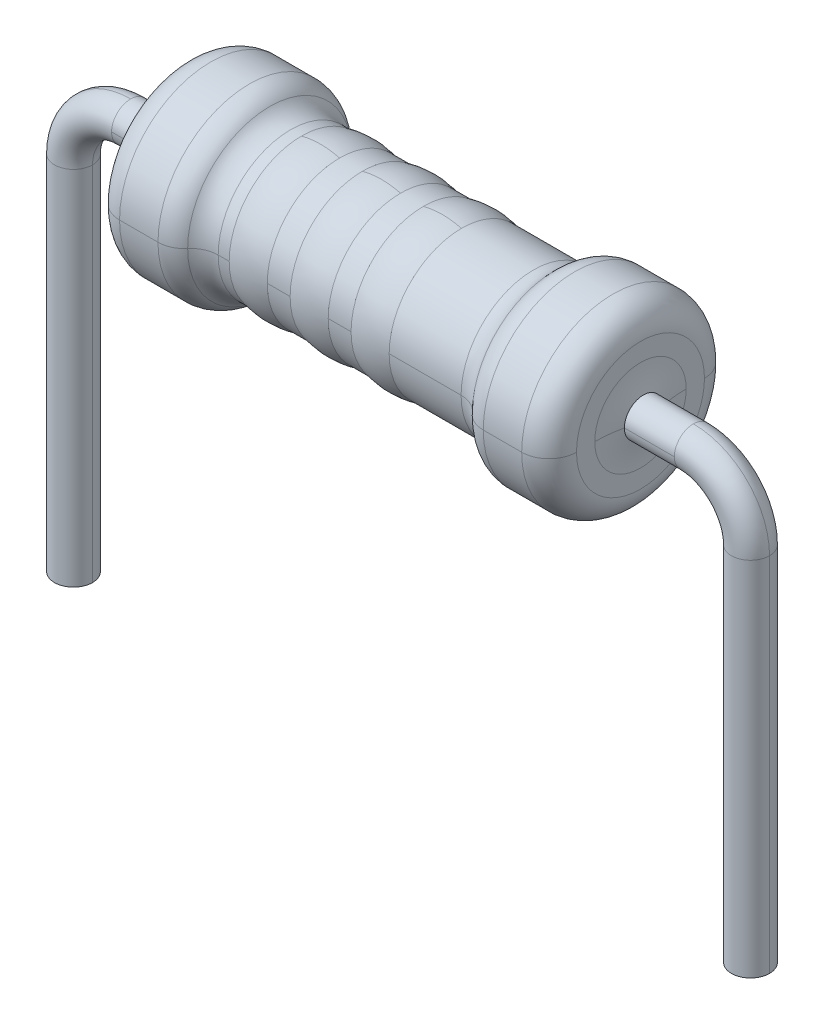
ISO-10303-21;
HEADER;
FILE_DESCRIPTION(('STEP AP214'),'2;1');
FILE_NAME('part.step','',(''),(''),'','','');
FILE_SCHEMA(('AUTOMOTIVE_DESIGN { 1 0 10303 214 1 1 1 1 }'));
ENDSEC;
DATA;
#1=APPLICATION_CONTEXT('core data for automotive mechanical design processes');
#2=APPLICATION_PROTOCOL_DEFINITION('international standard','automotive_design',2000,#1);
#3=PRODUCT_CONTEXT('',#1,'mechanical');
#4=PRODUCT('Part','Part','',(#3));
#5=PRODUCT_RELATED_PRODUCT_CATEGORY('part','',(#4));
#6=PRODUCT_DEFINITION_FORMATION('','',#4);
#7=PRODUCT_DEFINITION_CONTEXT('part definition',#1,'design');
#8=PRODUCT_DEFINITION('design','',#6,#7);
#9=PRODUCT_DEFINITION_SHAPE('','',#8);
#10=(LENGTH_UNIT() NAMED_UNIT(*) SI_UNIT(.MILLI.,.METRE.));
#11=(NAMED_UNIT(*) PLANE_ANGLE_UNIT() SI_UNIT($,.RADIAN.));
#12=(NAMED_UNIT(*) SI_UNIT($,.STERADIAN.) SOLID_ANGLE_UNIT());
#13=UNCERTAINTY_MEASURE_WITH_UNIT(LENGTH_MEASURE(1.E-05),#10,'distance_accuracy_value','');
#14=(GEOMETRIC_REPRESENTATION_CONTEXT(3) GLOBAL_UNCERTAINTY_ASSIGNED_CONTEXT((#13)) GLOBAL_UNIT_ASSIGNED_CONTEXT((#10,
#11,#12)) REPRESENTATION_CONTEXT('',''));
#15=CARTESIAN_POINT('',(0.,0.,0.));
#16=DIRECTION('',(0.,0.,1.));
#17=DIRECTION('',(1.,0.,0.));
#18=AXIS2_PLACEMENT_3D('',#15,#16,#17);
#19=CARTESIAN_POINT('',(4.4445,-5.5,0.));
#20=DIRECTION('',(0.,1.,0.));
#21=DIRECTION('',(-1.,0.,0.));
#22=AXIS2_PLACEMENT_3D('',#19,#20,#21);
#23=PLANE('',#22);
#24=CARTESIAN_POINT('',(4.4445,-5.5,0.));
#25=DIRECTION('',(0.,1.,0.));
#26=DIRECTION('',(-1.,0.,0.));
#27=AXIS2_PLACEMENT_3D('',#24,#25,#26);
#28=CIRCLE('',#27,0.25);
#29=CARTESIAN_POINT('',(4.6945,-5.5,0.));
#30=VERTEX_POINT('',#29);
#31=CARTESIAN_POINT('',(4.1945,-5.5,0.));
#32=VERTEX_POINT('',#31);
#33=EDGE_CURVE('E168',#30,#32,#28,.T.);
#34=ORIENTED_EDGE('',*,*,#33,.F.);
#35=CARTESIAN_POINT('',(4.4445,-5.5,0.));
#36=DIRECTION('',(0.,1.,0.));
#37=DIRECTION('',(-1.,0.,0.));
#38=AXIS2_PLACEMENT_3D('',#35,#36,#37);
#39=CIRCLE('',#38,0.25);
#40=EDGE_CURVE('E20',#32,#30,#39,.T.);
#41=ORIENTED_EDGE('',*,*,#40,.F.);
#42=EDGE_LOOP('',(#34,#41));
#43=FACE_BOUND('',#42,.T.);
#44=ADVANCED_FACE('F17',(#43),#23,.F.);
#45=CARTESIAN_POINT('',(4.4445,-5.5,0.));
#46=DIRECTION('',(0.,1.,0.));
#47=DIRECTION('',(-1.,0.,0.));
#48=AXIS2_PLACEMENT_3D('',#45,#46,#47);
#49=CYLINDRICAL_SURFACE('',#48,0.25);
#50=CARTESIAN_POINT('',(4.4445,-0.75,0.));
#51=DIRECTION('',(0.,1.,0.));
#52=DIRECTION('',(1.,0.,0.));
#53=AXIS2_PLACEMENT_3D('',#50,#51,#52);
#54=CIRCLE('',#53,0.25);
#55=CARTESIAN_POINT('',(4.1945,-0.75,0.));
#56=VERTEX_POINT('',#55);
#57=CARTESIAN_POINT('',(4.6945,-0.75,0.));
#58=VERTEX_POINT('',#57);
#59=EDGE_CURVE('E633',#56,#58,#54,.T.);
#60=ORIENTED_EDGE('',*,*,#59,.F.);
#61=DIRECTION('',(0.,1.,0.));
#62=VECTOR('',#61,1.);
#63=CARTESIAN_POINT('',(4.1945,-5.5,0.));
#64=LINE('',#63,#62);
#65=EDGE_CURVE('E166',#32,#56,#64,.T.);
#66=ORIENTED_EDGE('',*,*,#65,.F.);
#67=ORIENTED_EDGE('',*,*,#40,.T.);
#68=DIRECTION('',(0.,1.,0.));
#69=VECTOR('',#68,1.);
#70=CARTESIAN_POINT('',(4.6945,-5.5,0.));
#71=LINE('',#70,#69);
#72=EDGE_CURVE('E163',#58,#30,#71,.F.);
#73=ORIENTED_EDGE('',*,*,#72,.F.);
#74=EDGE_LOOP('',(#60,#66,#67,#73));
#75=FACE_BOUND('',#74,.T.);
#76=ADVANCED_FACE('F161',(#75),#49,.T.);
#77=CARTESIAN_POINT('',(4.4445,-5.5,0.));
#78=DIRECTION('',(0.,1.,0.));
#79=DIRECTION('',(-1.,0.,0.));
#80=AXIS2_PLACEMENT_3D('',#77,#78,#79);
#81=CYLINDRICAL_SURFACE('',#80,0.25);
#82=ORIENTED_EDGE('',*,*,#65,.T.);
#83=CARTESIAN_POINT('',(4.4445,-0.75,0.));
#84=DIRECTION('',(0.,1.,0.));
#85=DIRECTION('',(1.,0.,0.));
#86=AXIS2_PLACEMENT_3D('',#83,#84,#85);
#87=CIRCLE('',#86,0.25);
#88=EDGE_CURVE('E173',#58,#56,#87,.T.);
#89=ORIENTED_EDGE('',*,*,#88,.F.);
#90=ORIENTED_EDGE('',*,*,#72,.T.);
#91=ORIENTED_EDGE('',*,*,#33,.T.);
#92=EDGE_LOOP('',(#82,#89,#90,#91));
#93=FACE_BOUND('',#92,.T.);
#94=ADVANCED_FACE('F171',(#93),#81,.T.);
#95=CARTESIAN_POINT('',(3.6945,-0.75,0.));
#96=DIRECTION('',(0.,0.,1.));
#97=DIRECTION('',(1.,0.,0.));
#98=AXIS2_PLACEMENT_3D('',#95,#96,#97);
#99=TOROIDAL_SURFACE('',#98,0.75,0.25);
#100=CARTESIAN_POINT('',(3.6945,0.,0.));
#101=DIRECTION('',(-1.,0.,0.));
#102=DIRECTION('',(0.,0.,1.));
#103=AXIS2_PLACEMENT_3D('',#100,#101,#102);
#104=CIRCLE('',#103,0.25);
#105=CARTESIAN_POINT('',(3.6945,-0.25,0.));
#106=VERTEX_POINT('',#105);
#107=CARTESIAN_POINT('',(3.6945,0.,0.25));
#108=VERTEX_POINT('',#107);
#109=EDGE_CURVE('E586',#106,#108,#104,.T.);
#110=ORIENTED_EDGE('',*,*,#109,.F.);
#111=CARTESIAN_POINT('',(3.6945,-0.75,0.));
#112=DIRECTION('',(0.,0.,1.));
#113=DIRECTION('',(1.,0.,0.));
#114=AXIS2_PLACEMENT_3D('',#111,#112,#113);
#115=CIRCLE('',#114,0.5);
#116=EDGE_CURVE('E604',#56,#106,#115,.T.);
#117=ORIENTED_EDGE('',*,*,#116,.F.);
#118=ORIENTED_EDGE('',*,*,#59,.T.);
#119=CARTESIAN_POINT('',(3.6945,-0.75,0.));
#120=DIRECTION('',(0.,0.,1.));
#121=DIRECTION('',(1.,0.,0.));
#122=AXIS2_PLACEMENT_3D('',#119,#120,#121);
#123=CIRCLE('',#122,1.);
#124=CARTESIAN_POINT('',(3.6945,0.25,0.));
#125=VERTEX_POINT('',#124);
#126=EDGE_CURVE('E613',#125,#58,#123,.F.);
#127=ORIENTED_EDGE('',*,*,#126,.F.);
#128=CARTESIAN_POINT('',(3.6945,0.,0.));
#129=DIRECTION('',(-1.,0.,0.));
#130=DIRECTION('',(0.,0.,1.));
#131=AXIS2_PLACEMENT_3D('',#128,#129,#130);
#132=CIRCLE('',#131,0.25);
#133=EDGE_CURVE('E594',#108,#125,#132,.T.);
#134=ORIENTED_EDGE('',*,*,#133,.F.);
#135=EDGE_LOOP('',(#110,#117,#118,#127,#134));
#136=FACE_BOUND('',#135,.T.);
#137=ADVANCED_FACE('F620',(#136),#99,.T.);
#138=CARTESIAN_POINT('',(3.6945,-0.75,0.));
#139=DIRECTION('',(0.,0.,1.));
#140=DIRECTION('',(1.,0.,0.));
#141=AXIS2_PLACEMENT_3D('',#138,#139,#140);
#142=TOROIDAL_SURFACE('',#141,0.75,0.25);
#143=CARTESIAN_POINT('',(3.6945,0.,0.));
#144=DIRECTION('',(-1.,0.,0.));
#145=DIRECTION('',(0.,0.,1.));
#146=AXIS2_PLACEMENT_3D('',#143,#144,#145);
#147=CIRCLE('',#146,0.25);
#148=CARTESIAN_POINT('',(3.6945,0.,-0.25));
#149=VERTEX_POINT('',#148);
#150=EDGE_CURVE('E595',#149,#106,#147,.T.);
#151=ORIENTED_EDGE('',*,*,#150,.F.);
#152=CARTESIAN_POINT('',(3.6945,0.,0.));
#153=DIRECTION('',(-1.,0.,0.));
#154=DIRECTION('',(0.,0.,1.));
#155=AXIS2_PLACEMENT_3D('',#152,#153,#154);
#156=CIRCLE('',#155,0.25);
#157=EDGE_CURVE('E566',#125,#149,#156,.T.);
#158=ORIENTED_EDGE('',*,*,#157,.F.);
#159=ORIENTED_EDGE('',*,*,#126,.T.);
#160=ORIENTED_EDGE('',*,*,#88,.T.);
#161=ORIENTED_EDGE('',*,*,#116,.T.);
#162=EDGE_LOOP('',(#151,#158,#159,#160,#161));
#163=FACE_BOUND('',#162,.T.);
#164=ADVANCED_FACE('F616',(#163),#142,.T.);
#165=CARTESIAN_POINT('',(3.6945,0.,0.));
#166=DIRECTION('',(-1.,0.,0.));
#167=DIRECTION('',(0.,0.,1.));
#168=AXIS2_PLACEMENT_3D('',#165,#166,#167);
#169=CYLINDRICAL_SURFACE('',#168,0.25);
#170=DIRECTION('',(-1.,0.,0.));
#171=VECTOR('',#170,1.);
#172=CARTESIAN_POINT('',(3.6945,0.,0.25));
#173=LINE('',#172,#171);
#174=CARTESIAN_POINT('',(3.038139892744,0.,0.25));
#175=VERTEX_POINT('',#174);
#176=EDGE_CURVE('E556',#175,#108,#173,.F.);
#177=ORIENTED_EDGE('',*,*,#176,.F.);
#178=CARTESIAN_POINT('',(3.038139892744,0.,0.));
#179=DIRECTION('',(-1.,0.,0.));
#180=DIRECTION('',(0.,0.,-1.));
#181=AXIS2_PLACEMENT_3D('',#178,#179,#180);
#182=CIRCLE('',#181,0.25);
#183=CARTESIAN_POINT('',(3.038139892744,0.,-0.25));
#184=VERTEX_POINT('',#183);
#185=EDGE_CURVE('E547',#175,#184,#182,.F.);
#186=ORIENTED_EDGE('',*,*,#185,.T.);
#187=DIRECTION('',(-1.,0.,0.));
#188=VECTOR('',#187,1.);
#189=CARTESIAN_POINT('',(3.6945,0.,-0.25));
#190=LINE('',#189,#188);
#191=EDGE_CURVE('E561',#149,#184,#190,.T.);
#192=ORIENTED_EDGE('',*,*,#191,.F.);
#193=ORIENTED_EDGE('',*,*,#150,.T.);
#194=ORIENTED_EDGE('',*,*,#109,.T.);
#195=EDGE_LOOP('',(#177,#186,#192,#193,#194));
#196=FACE_BOUND('',#195,.T.);
#197=ADVANCED_FACE('F619',(#196),#169,.T.);
#198=CARTESIAN_POINT('',(3.6945,0.,0.));
#199=DIRECTION('',(-1.,0.,0.));
#200=DIRECTION('',(0.,0.,1.));
#201=AXIS2_PLACEMENT_3D('',#198,#199,#200);
#202=CYLINDRICAL_SURFACE('',#201,0.25);
#203=CARTESIAN_POINT('',(3.038139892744,0.,0.));
#204=DIRECTION('',(-1.,0.,0.));
#205=DIRECTION('',(0.,0.,-1.));
#206=AXIS2_PLACEMENT_3D('',#203,#204,#205);
#207=CIRCLE('',#206,0.25);
#208=EDGE_CURVE('E1220',#184,#175,#207,.F.);
#209=ORIENTED_EDGE('',*,*,#208,.T.);
#210=ORIENTED_EDGE('',*,*,#176,.T.);
#211=ORIENTED_EDGE('',*,*,#133,.T.);
#212=ORIENTED_EDGE('',*,*,#157,.T.);
#213=ORIENTED_EDGE('',*,*,#191,.T.);
#214=EDGE_LOOP('',(#209,#210,#211,#212,#213));
#215=FACE_BOUND('',#214,.T.);
#216=ADVANCED_FACE('F531',(#215),#202,.T.);
#217=CARTESIAN_POINT('',(3.038139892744,0.,-0.25));
#218=CARTESIAN_POINT('',(3.019144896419,0.,-0.336121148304));
#219=CARTESIAN_POINT('',(3.006381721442,0.,-0.423617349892));
#220=CARTESIAN_POINT('',(3.,0.,-0.511808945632));
#221=CARTESIAN_POINT('',(3.,0.,-0.6));
#222=(BOUNDED_CURVE() B_SPLINE_CURVE(4,(#217,#218,#219,#220,#221),.UNSPECIFIED.,.F.,
.F.) B_SPLINE_CURVE_WITH_KNOTS((5,5),(4.495303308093,4.712388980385),
.UNSPECIFIED.) CURVE() GEOMETRIC_REPRESENTATION_ITEM() RATIONAL_B_SPLINE_CURVE((1.,1.,1.,1.,1.)) REPRESENTATION_ITEM(''));
#223=CARTESIAN_POINT('',(4.625,0.,0.));
#224=DIRECTION('',(-1.,0.,0.));
#225=AXIS1_PLACEMENT('',#223,#224);
#226=SURFACE_OF_REVOLUTION('',#222,#225);
#227=CARTESIAN_POINT('',(3.038139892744,0.,0.25));
#228=CARTESIAN_POINT('',(3.03497400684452,0.,0.26435352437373));
#229=CARTESIAN_POINT('',(3.03200296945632,0.,0.278750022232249));
#230=CARTESIAN_POINT('',(3.02645255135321,0.,0.307618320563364));
#231=CARTESIAN_POINT('',(3.02387317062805,0.,0.32209012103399));
#232=CARTESIAN_POINT('',(3.01910802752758,0.,0.351098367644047));
#233=CARTESIAN_POINT('',(3.01692226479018,0.,0.365634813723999));
#234=CARTESIAN_POINT('',(3.01294595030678,0.,0.394761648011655));
#235=CARTESIAN_POINT('',(3.01115539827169,0.,0.409352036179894));
#236=CARTESIAN_POINT('',(3.00797082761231,0.,0.438576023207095));
#237=CARTESIAN_POINT('',(3.00657680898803,0.,0.453209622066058));
#238=CARTESIAN_POINT('',(3.00418632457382,0.,0.482509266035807));
#239=CARTESIAN_POINT('',(3.0031898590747,0.,0.497175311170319));
#240=CARTESIAN_POINT('',(3.00159523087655,0.,0.526529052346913));
#241=CARTESIAN_POINT('',(3.00099706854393,0.,0.541216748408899));
#242=CARTESIAN_POINT('',(3.00019942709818,0.,0.570602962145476));
#243=CARTESIAN_POINT('',(2.99999994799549,0.,0.585301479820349));
#244=CARTESIAN_POINT('',(3.,0.,0.6));
#245=B_SPLINE_CURVE_WITH_KNOTS('',3,(#227,#228,#229,#230,#231,#232,#233,#234,#235,#236,#237,
#238,#239,#240,#241,#242,#243,#244),.UNSPECIFIED.,.F.,.F.,(4,2,2,2,2,2,2,2,4),(0.,
0.0440942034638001,0.0881884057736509,0.132282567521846,0.176376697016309,0.220470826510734,
0.264564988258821,0.308659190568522,0.352753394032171),.UNSPECIFIED.);
#246=CARTESIAN_POINT('',(3.,0.,0.6));
#247=VERTEX_POINT('',#246);
#248=EDGE_CURVE('E1221',#175,#247,#245,.T.);
#249=ORIENTED_EDGE('',*,*,#248,.T.);
#250=CARTESIAN_POINT('',(3.,0.,0.));
#251=DIRECTION('',(1.,0.,0.));
#252=DIRECTION('',(0.,0.,1.));
#253=AXIS2_PLACEMENT_3D('',#250,#251,#252);
#254=CIRCLE('',#253,0.6);
#255=CARTESIAN_POINT('',(3.,0.,-0.6));
#256=VERTEX_POINT('',#255);
#257=EDGE_CURVE('E429',#247,#256,#254,.T.);
#258=ORIENTED_EDGE('',*,*,#257,.T.);
#259=CARTESIAN_POINT('',(3.,0.,-0.6));
#260=CARTESIAN_POINT('',(2.99999994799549,0.,-0.585301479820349));
#261=CARTESIAN_POINT('',(3.00019942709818,0.,-0.570602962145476));
#262=CARTESIAN_POINT('',(3.00099706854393,0.,-0.541216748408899));
#263=CARTESIAN_POINT('',(3.00159523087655,0.,-0.526529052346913));
#264=CARTESIAN_POINT('',(3.0031898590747,0.,-0.497175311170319));
#265=CARTESIAN_POINT('',(3.00418632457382,0.,-0.482509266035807));
#266=CARTESIAN_POINT('',(3.00657680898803,0.,-0.453209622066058));
#267=CARTESIAN_POINT('',(3.00797082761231,0.,-0.438576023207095));
#268=CARTESIAN_POINT('',(3.01115539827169,0.,-0.409352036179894));
#269=CARTESIAN_POINT('',(3.01294595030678,0.,-0.394761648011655));
#270=CARTESIAN_POINT('',(3.01692226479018,0.,-0.365634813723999));
#271=CARTESIAN_POINT('',(3.01910802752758,0.,-0.351098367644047));
#272=CARTESIAN_POINT('',(3.02387317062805,0.,-0.32209012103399));
#273=CARTESIAN_POINT('',(3.02645255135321,0.,-0.307618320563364));
#274=CARTESIAN_POINT('',(3.03200296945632,0.,-0.278750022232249));
#275=CARTESIAN_POINT('',(3.03497400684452,0.,-0.26435352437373));
#276=CARTESIAN_POINT('',(3.038139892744,0.,-0.25));
#277=B_SPLINE_CURVE_WITH_KNOTS('',3,(#259,#260,#261,#262,#263,#264,#265,#266,#267,#268,#269,
#270,#271,#272,#273,#274,#275,#276),.UNSPECIFIED.,.F.,.F.,(4,2,2,2,2,2,2,2,4),(0.,
0.0440942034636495,0.0881884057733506,0.132282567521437,0.176376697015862,0.220470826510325,
0.26456498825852,0.308659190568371,0.352753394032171),.UNSPECIFIED.);
#278=EDGE_CURVE('E555',#256,#184,#277,.T.);
#279=ORIENTED_EDGE('',*,*,#278,.T.);
#280=ORIENTED_EDGE('',*,*,#185,.F.);
#281=EDGE_LOOP('',(#249,#258,#279,#280));
#282=FACE_BOUND('',#281,.T.);
#283=ADVANCED_FACE('F527',(#282),#226,.T.);
#284=CARTESIAN_POINT('',(3.038139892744,0.,-0.25));
#285=CARTESIAN_POINT('',(3.019144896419,0.,-0.336121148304));
#286=CARTESIAN_POINT('',(3.006381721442,0.,-0.423617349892));
#287=CARTESIAN_POINT('',(3.,0.,-0.511808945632));
#288=CARTESIAN_POINT('',(3.,0.,-0.6));
#289=(BOUNDED_CURVE() B_SPLINE_CURVE(4,(#284,#285,#286,#287,#288),.UNSPECIFIED.,.F.,
.F.) B_SPLINE_CURVE_WITH_KNOTS((5,5),(4.495303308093,4.712388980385),
.UNSPECIFIED.) CURVE() GEOMETRIC_REPRESENTATION_ITEM() RATIONAL_B_SPLINE_CURVE((1.,1.,1.,1.,1.)) REPRESENTATION_ITEM(''));
#290=CARTESIAN_POINT('',(4.625,0.,0.));
#291=DIRECTION('',(-1.,0.,0.));
#292=AXIS1_PLACEMENT('',#290,#291);
#293=SURFACE_OF_REVOLUTION('',#289,#292);
#294=ORIENTED_EDGE('',*,*,#208,.F.);
#295=ORIENTED_EDGE('',*,*,#278,.F.);
#296=CARTESIAN_POINT('',(3.,0.,0.));
#297=DIRECTION('',(1.,0.,0.));
#298=DIRECTION('',(0.,0.,-1.));
#299=AXIS2_PLACEMENT_3D('',#296,#297,#298);
#300=CIRCLE('',#299,0.6);
#301=EDGE_CURVE('E510',#256,#247,#300,.T.);
#302=ORIENTED_EDGE('',*,*,#301,.T.);
#303=ORIENTED_EDGE('',*,*,#248,.F.);
#304=EDGE_LOOP('',(#294,#295,#302,#303));
#305=FACE_BOUND('',#304,.T.);
#306=ADVANCED_FACE('F443',(#305),#293,.T.);
#307=CARTESIAN_POINT('',(3.,0.,0.));
#308=DIRECTION('',(-1.,0.,0.));
#309=DIRECTION('',(0.,0.,1.));
#310=AXIS2_PLACEMENT_3D('',#307,#308,#309);
#311=PLANE('',#310);
#312=CARTESIAN_POINT('',(3.,0.,0.));
#313=DIRECTION('',(-1.,0.,0.));
#314=DIRECTION('',(0.,0.,1.));
#315=AXIS2_PLACEMENT_3D('',#312,#313,#314);
#316=CIRCLE('',#315,0.84);
#317=CARTESIAN_POINT('',(3.,0.,0.84));
#318=VERTEX_POINT('',#317);
#319=CARTESIAN_POINT('',(3.,0.,-0.84));
#320=VERTEX_POINT('',#319);
#321=EDGE_CURVE('E419',#318,#320,#316,.T.);
#322=ORIENTED_EDGE('',*,*,#321,.F.);
#323=CARTESIAN_POINT('',(3.,0.,0.));
#324=DIRECTION('',(-1.,0.,0.));
#325=DIRECTION('',(0.,0.,-1.));
#326=AXIS2_PLACEMENT_3D('',#323,#324,#325);
#327=CIRCLE('',#326,0.84);
#328=EDGE_CURVE('E468',#320,#318,#327,.T.);
#329=ORIENTED_EDGE('',*,*,#328,.F.);
#330=EDGE_LOOP('',(#322,#329));
#331=FACE_BOUND('',#330,.T.);
#332=ORIENTED_EDGE('',*,*,#257,.F.);
#333=ORIENTED_EDGE('',*,*,#301,.F.);
#334=EDGE_LOOP('',(#332,#333));
#335=FACE_BOUND('',#334,.T.);
#336=ADVANCED_FACE('F434',(#331,#335),#311,.F.);
#337=CARTESIAN_POINT('',(2.64,0.,0.));
#338=DIRECTION('',(-1.,0.,0.));
#339=DIRECTION('',(0.,0.,1.));
#340=AXIS2_PLACEMENT_3D('',#337,#338,#339);
#341=TOROIDAL_SURFACE('',#340,0.84,0.36);
#342=CARTESIAN_POINT('',(2.64,0.,0.84));
#343=DIRECTION('',(0.,1.,0.));
#344=DIRECTION('',(0.,0.,1.));
#345=AXIS2_PLACEMENT_3D('',#342,#343,#344);
#346=CIRCLE('',#345,0.36);
#347=CARTESIAN_POINT('',(2.64,0.,1.2));
#348=VERTEX_POINT('',#347);
#349=EDGE_CURVE('E410',#348,#318,#346,.T.);
#350=ORIENTED_EDGE('',*,*,#349,.F.);
#351=CARTESIAN_POINT('',(2.64,0.,0.));
#352=DIRECTION('',(-1.,0.,0.));
#353=DIRECTION('',(0.,0.,1.));
#354=AXIS2_PLACEMENT_3D('',#351,#352,#353);
#355=CIRCLE('',#354,1.2);
#356=CARTESIAN_POINT('',(2.64,0.,-1.2));
#357=VERTEX_POINT('',#356);
#358=EDGE_CURVE('E413',#357,#348,#355,.T.);
#359=ORIENTED_EDGE('',*,*,#358,.F.);
#360=CARTESIAN_POINT('',(2.64,0.,-0.84));
#361=DIRECTION('',(0.,-1.,0.));
#362=DIRECTION('',(0.,0.,-1.));
#363=AXIS2_PLACEMENT_3D('',#360,#361,#362);
#364=CIRCLE('',#363,0.36);
#365=EDGE_CURVE('E414',#320,#357,#364,.F.);
#366=ORIENTED_EDGE('',*,*,#365,.F.);
#367=ORIENTED_EDGE('',*,*,#328,.T.);
#368=EDGE_LOOP('',(#350,#359,#366,#367));
#369=FACE_BOUND('',#368,.T.);
#370=ADVANCED_FACE('F399',(#369),#341,.T.);
#371=CARTESIAN_POINT('',(2.64,0.,0.));
#372=DIRECTION('',(-1.,0.,0.));
#373=DIRECTION('',(0.,0.,1.));
#374=AXIS2_PLACEMENT_3D('',#371,#372,#373);
#375=TOROIDAL_SURFACE('',#374,0.84,0.36);
#376=CARTESIAN_POINT('',(2.64,0.,0.));
#377=DIRECTION('',(-1.,0.,0.));
#378=DIRECTION('',(0.,0.,1.));
#379=AXIS2_PLACEMENT_3D('',#376,#377,#378);
#380=CIRCLE('',#379,1.2);
#381=EDGE_CURVE('E1235',#348,#357,#380,.T.);
#382=ORIENTED_EDGE('',*,*,#381,.F.);
#383=ORIENTED_EDGE('',*,*,#349,.T.);
#384=ORIENTED_EDGE('',*,*,#321,.T.);
#385=ORIENTED_EDGE('',*,*,#365,.T.);
#386=EDGE_LOOP('',(#382,#383,#384,#385));
#387=FACE_BOUND('',#386,.T.);
#388=ADVANCED_FACE('F393',(#387),#375,.T.);
#389=CARTESIAN_POINT('',(-3.,0.,0.));
#390=DIRECTION('',(-1.,0.,0.));
#391=DIRECTION('',(0.,0.,1.));
#392=AXIS2_PLACEMENT_3D('',#389,#390,#391);
#393=CYLINDRICAL_SURFACE('',#392,1.2);
#394=DIRECTION('',(-1.,0.,0.));
#395=VECTOR('',#394,1.);
#396=CARTESIAN_POINT('',(-3.,0.,1.2));
#397=LINE('',#396,#395);
#398=CARTESIAN_POINT('',(2.135410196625,0.,1.2));
#399=VERTEX_POINT('',#398);
#400=EDGE_CURVE('E1240',#399,#348,#397,.F.);
#401=ORIENTED_EDGE('',*,*,#400,.F.);
#402=CARTESIAN_POINT('',(2.135410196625,0.,0.));
#403=DIRECTION('',(-1.,0.,0.));
#404=DIRECTION('',(0.,0.,1.));
#405=AXIS2_PLACEMENT_3D('',#402,#403,#404);
#406=CIRCLE('',#405,1.2);
#407=CARTESIAN_POINT('',(2.135410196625,0.,-1.2));
#408=VERTEX_POINT('',#407);
#409=EDGE_CURVE('E380',#408,#399,#406,.T.);
#410=ORIENTED_EDGE('',*,*,#409,.F.);
#411=DIRECTION('',(-1.,0.,0.));
#412=VECTOR('',#411,1.);
#413=CARTESIAN_POINT('',(-3.,0.,-1.2));
#414=LINE('',#413,#412);
#415=EDGE_CURVE('E1239',#357,#408,#414,.T.);
#416=ORIENTED_EDGE('',*,*,#415,.F.);
#417=ORIENTED_EDGE('',*,*,#358,.T.);
#418=EDGE_LOOP('',(#401,#410,#416,#417));
#419=FACE_BOUND('',#418,.T.);
#420=ADVANCED_FACE('F389',(#419),#393,.T.);
#421=CARTESIAN_POINT('',(-3.,0.,0.));
#422=DIRECTION('',(-1.,0.,0.));
#423=DIRECTION('',(0.,0.,1.));
#424=AXIS2_PLACEMENT_3D('',#421,#422,#423);
#425=CYLINDRICAL_SURFACE('',#424,1.2);
#426=CARTESIAN_POINT('',(2.135410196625,0.,0.));
#427=DIRECTION('',(-1.,0.,0.));
#428=DIRECTION('',(0.,0.,1.));
#429=AXIS2_PLACEMENT_3D('',#426,#427,#428);
#430=CIRCLE('',#429,1.2);
#431=EDGE_CURVE('E371',#399,#408,#430,.T.);
#432=ORIENTED_EDGE('',*,*,#431,.F.);
#433=ORIENTED_EDGE('',*,*,#400,.T.);
#434=ORIENTED_EDGE('',*,*,#381,.T.);
#435=ORIENTED_EDGE('',*,*,#415,.T.);
#436=EDGE_LOOP('',(#432,#433,#434,#435));
#437=FACE_BOUND('',#436,.T.);
#438=ADVANCED_FACE('F385',(#437),#425,.T.);
#439=CARTESIAN_POINT('',(2.135410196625,0.,0.));
#440=DIRECTION('',(-1.,0.,0.));
#441=DIRECTION('',(0.,0.,1.));
#442=AXIS2_PLACEMENT_3D('',#439,#440,#441);
#443=TOROIDAL_SURFACE('',#442,0.85,0.35);
#444=CARTESIAN_POINT('',(2.135410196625,0.,0.85));
#445=DIRECTION('',(0.,1.,0.));
#446=DIRECTION('',(0.,0.,1.));
#447=AXIS2_PLACEMENT_3D('',#444,#445,#446);
#448=CIRCLE('',#447,0.35);
#449=CARTESIAN_POINT('',(1.86880253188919,0.,1.07676056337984));
#450=VERTEX_POINT('',#449);
#451=EDGE_CURVE('E360',#450,#399,#448,.T.);
#452=ORIENTED_EDGE('',*,*,#451,.F.);
#453=CARTESIAN_POINT('',(1.86880253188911,0.,0.));
#454=DIRECTION('',(-1.,0.,0.));
#455=DIRECTION('',(0.,0.,1.));
#456=AXIS2_PLACEMENT_3D('',#453,#454,#455);
#457=CIRCLE('',#456,1.0767605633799);
#458=CARTESIAN_POINT('',(1.86880253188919,0.,-1.07676056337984));
#459=VERTEX_POINT('',#458);
#460=EDGE_CURVE('E356',#450,#459,#457,.F.);
#461=ORIENTED_EDGE('',*,*,#460,.T.);
#462=CARTESIAN_POINT('',(2.135410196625,0.,-0.85));
#463=DIRECTION('',(0.,-1.,0.));
#464=DIRECTION('',(0.,0.,-1.));
#465=AXIS2_PLACEMENT_3D('',#462,#463,#464);
#466=CIRCLE('',#465,0.35);
#467=EDGE_CURVE('E368',#408,#459,#466,.F.);
#468=ORIENTED_EDGE('',*,*,#467,.F.);
#469=ORIENTED_EDGE('',*,*,#409,.T.);
#470=EDGE_LOOP('',(#452,#461,#468,#469));
#471=FACE_BOUND('',#470,.T.);
#472=ADVANCED_FACE('F382',(#471),#443,.T.);
#473=CARTESIAN_POINT('',(2.135410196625,0.,0.));
#474=DIRECTION('',(-1.,0.,0.));
#475=DIRECTION('',(0.,0.,1.));
#476=AXIS2_PLACEMENT_3D('',#473,#474,#475);
#477=TOROIDAL_SURFACE('',#476,0.85,0.35);
#478=CARTESIAN_POINT('',(1.86880253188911,0.,0.));
#479=DIRECTION('',(-1.,0.,0.));
#480=DIRECTION('',(0.,0.,1.));
#481=AXIS2_PLACEMENT_3D('',#478,#479,#480);
#482=CIRCLE('',#481,1.0767605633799);
#483=EDGE_CURVE('E359',#459,#450,#482,.F.);
#484=ORIENTED_EDGE('',*,*,#483,.T.);
#485=ORIENTED_EDGE('',*,*,#451,.T.);
#486=ORIENTED_EDGE('',*,*,#431,.T.);
#487=ORIENTED_EDGE('',*,*,#467,.T.);
#488=EDGE_LOOP('',(#484,#485,#486,#487));
#489=FACE_BOUND('',#488,.T.);
#490=ADVANCED_FACE('F347',(#489),#477,.T.);
#491=CARTESIAN_POINT('',(1.594577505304,0.,0.));
#492=DIRECTION('',(-1.,0.,0.));
#493=DIRECTION('',(0.,0.,1.));
#494=AXIS2_PLACEMENT_3D('',#491,#492,#493);
#495=TOROIDAL_SURFACE('',#494,1.309999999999,0.36);
#496=CARTESIAN_POINT('',(1.594577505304,0.,-1.309999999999));
#497=DIRECTION('',(0.,-1.,0.));
#498=DIRECTION('',(0.,0.,-1.));
#499=AXIS2_PLACEMENT_3D('',#496,#497,#498);
#500=CIRCLE('',#499,0.36);
#501=CARTESIAN_POINT('',(1.594577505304,0.,-0.94999999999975));
#502=VERTEX_POINT('',#501);
#503=EDGE_CURVE('E325',#502,#459,#500,.F.);
#504=ORIENTED_EDGE('',*,*,#503,.T.);
#505=ORIENTED_EDGE('',*,*,#460,.F.);
#506=CARTESIAN_POINT('',(1.594577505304,0.,1.309999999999));
#507=DIRECTION('',(0.,1.,0.));
#508=DIRECTION('',(0.,0.,1.));
#509=AXIS2_PLACEMENT_3D('',#506,#507,#508);
#510=CIRCLE('',#509,0.36);
#511=CARTESIAN_POINT('',(1.594577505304,0.,0.94999999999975));
#512=VERTEX_POINT('',#511);
#513=EDGE_CURVE('E333',#450,#512,#510,.T.);
#514=ORIENTED_EDGE('',*,*,#513,.T.);
#515=CARTESIAN_POINT('',(1.594577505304,0.,0.));
#516=DIRECTION('',(-1.,0.,0.));
#517=DIRECTION('',(0.,0.,1.));
#518=AXIS2_PLACEMENT_3D('',#515,#516,#517);
#519=CIRCLE('',#518,0.95);
#520=EDGE_CURVE('E322',#502,#512,#519,.T.);
#521=ORIENTED_EDGE('',*,*,#520,.F.);
#522=EDGE_LOOP('',(#504,#505,#514,#521));
#523=FACE_BOUND('',#522,.T.);
#524=ADVANCED_FACE('F341',(#523),#495,.F.);
#525=CARTESIAN_POINT('',(1.594577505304,0.,0.));
#526=DIRECTION('',(-1.,0.,0.));
#527=DIRECTION('',(0.,0.,1.));
#528=AXIS2_PLACEMENT_3D('',#525,#526,#527);
#529=TOROIDAL_SURFACE('',#528,1.309999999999,0.36);
#530=CARTESIAN_POINT('',(1.594577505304,0.,0.));
#531=DIRECTION('',(-1.,0.,0.));
#532=DIRECTION('',(0.,0.,1.));
#533=AXIS2_PLACEMENT_3D('',#530,#531,#532);
#534=CIRCLE('',#533,0.95);
#535=EDGE_CURVE('E312',#512,#502,#534,.T.);
#536=ORIENTED_EDGE('',*,*,#535,.F.);
#537=ORIENTED_EDGE('',*,*,#513,.F.);
#538=ORIENTED_EDGE('',*,*,#483,.F.);
#539=ORIENTED_EDGE('',*,*,#503,.F.);
#540=EDGE_LOOP('',(#536,#537,#538,#539));
#541=FACE_BOUND('',#540,.T.);
#542=ADVANCED_FACE('F336',(#541),#529,.F.);
#543=CARTESIAN_POINT('',(-3.,0.,0.));
#544=DIRECTION('',(-1.,0.,0.));
#545=DIRECTION('',(0.,0.,1.));
#546=AXIS2_PLACEMENT_3D('',#543,#544,#545);
#547=CYLINDRICAL_SURFACE('',#546,0.95);
#548=CARTESIAN_POINT('',(0.65,0.,0.));
#549=DIRECTION('',(-1.,0.,0.));
#550=DIRECTION('',(0.,0.,1.));
#551=AXIS2_PLACEMENT_3D('',#548,#549,#550);
#552=CIRCLE('',#551,0.95);
#553=CARTESIAN_POINT('',(0.65,-0.94999999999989,0.));
#554=VERTEX_POINT('',#553);
#555=CARTESIAN_POINT('',(0.65,0.,0.95));
#556=VERTEX_POINT('',#555);
#557=EDGE_CURVE('E285',#554,#556,#552,.T.);
#558=ORIENTED_EDGE('',*,*,#557,.F.);
#559=CARTESIAN_POINT('',(0.65,0.,0.));
#560=DIRECTION('',(-1.,0.,0.));
#561=DIRECTION('',(0.,0.,1.));
#562=AXIS2_PLACEMENT_3D('',#559,#560,#561);
#563=CIRCLE('',#562,0.95);
#564=CARTESIAN_POINT('',(0.65,0.,-0.95));
#565=VERTEX_POINT('',#564);
#566=EDGE_CURVE('E300',#565,#554,#563,.T.);
#567=ORIENTED_EDGE('',*,*,#566,.F.);
#568=DIRECTION('',(-1.,0.,0.));
#569=VECTOR('',#568,1.);
#570=CARTESIAN_POINT('',(-3.,0.,-0.95));
#571=LINE('',#570,#569);
#572=EDGE_CURVE('E305',#502,#565,#571,.T.);
#573=ORIENTED_EDGE('',*,*,#572,.F.);
#574=ORIENTED_EDGE('',*,*,#520,.T.);
#575=DIRECTION('',(-1.,0.,0.));
#576=VECTOR('',#575,1.);
#577=CARTESIAN_POINT('',(-3.,0.,0.95));
#578=LINE('',#577,#576);
#579=EDGE_CURVE('E301',#556,#512,#578,.F.);
#580=ORIENTED_EDGE('',*,*,#579,.F.);
#581=EDGE_LOOP('',(#558,#567,#573,#574,#580));
#582=FACE_BOUND('',#581,.T.);
#583=ADVANCED_FACE('F340',(#582),#547,.T.);
#584=CARTESIAN_POINT('',(-3.,0.,0.));
#585=DIRECTION('',(-1.,0.,0.));
#586=DIRECTION('',(0.,0.,1.));
#587=AXIS2_PLACEMENT_3D('',#584,#585,#586);
#588=CYLINDRICAL_SURFACE('',#587,0.95);
#589=CARTESIAN_POINT('',(0.65,0.,0.));
#590=DIRECTION('',(-1.,0.,0.));
#591=DIRECTION('',(0.,0.,1.));
#592=AXIS2_PLACEMENT_3D('',#589,#590,#591);
#593=CIRCLE('',#592,0.95);
#594=CARTESIAN_POINT('',(0.65,0.94999999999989,0.));
#595=VERTEX_POINT('',#594);
#596=EDGE_CURVE('E282',#556,#595,#593,.T.);
#597=ORIENTED_EDGE('',*,*,#596,.F.);
#598=ORIENTED_EDGE('',*,*,#579,.T.);
#599=ORIENTED_EDGE('',*,*,#535,.T.);
#600=ORIENTED_EDGE('',*,*,#572,.T.);
#601=CARTESIAN_POINT('',(0.65,0.,0.));
#602=DIRECTION('',(-1.,0.,0.));
#603=DIRECTION('',(0.,0.,1.));
#604=AXIS2_PLACEMENT_3D('',#601,#602,#603);
#605=CIRCLE('',#604,0.95);
#606=EDGE_CURVE('E294',#595,#565,#605,.T.);
#607=ORIENTED_EDGE('',*,*,#606,.F.);
#608=EDGE_LOOP('',(#597,#598,#599,#600,#607));
#609=FACE_BOUND('',#608,.T.);
#610=ADVANCED_FACE('F1058',(#609),#588,.T.);
#611=CARTESIAN_POINT('',(0.4,0.,0.));
#612=DIRECTION('',(0.,1.,0.));
#613=DIRECTION('',(1.,0.,0.));
#614=AXIS2_PLACEMENT_3D('',#611,#612,#613);
#615=SPHERICAL_SURFACE('',#614,0.982344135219);
#616=CARTESIAN_POINT('',(0.4,0.,0.));
#617=DIRECTION('',(0.,0.,-1.));
#618=DIRECTION('',(0.,1.,0.));
#619=AXIS2_PLACEMENT_3D('',#616,#617,#618);
#620=CIRCLE('',#619,0.982344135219);
#621=CARTESIAN_POINT('',(0.4,0.982344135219,0.));
#622=VERTEX_POINT('',#621);
#623=EDGE_CURVE('E281',#595,#622,#620,.F.);
#624=ORIENTED_EDGE('',*,*,#623,.F.);
#625=ORIENTED_EDGE('',*,*,#606,.T.);
#626=ORIENTED_EDGE('',*,*,#566,.T.);
#627=CARTESIAN_POINT('',(0.4,0.,0.));
#628=DIRECTION('',(0.,0.,-1.));
#629=DIRECTION('',(0.,1.,0.));
#630=AXIS2_PLACEMENT_3D('',#627,#628,#629);
#631=CIRCLE('',#630,0.982344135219);
#632=CARTESIAN_POINT('',(0.4,-0.982344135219,0.));
#633=VERTEX_POINT('',#632);
#634=EDGE_CURVE('E288',#633,#554,#631,.F.);
#635=ORIENTED_EDGE('',*,*,#634,.F.);
#636=CARTESIAN_POINT('',(0.4,0.,0.));
#637=DIRECTION('',(-1.21358818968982E-13,0.,1.));
#638=DIRECTION('',(0.,1.,0.));
#639=AXIS2_PLACEMENT_3D('',#636,#637,#638);
#640=CIRCLE('',#639,0.982344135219);
#641=CARTESIAN_POINT('',(0.15,-0.94999999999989,0.));
#642=VERTEX_POINT('',#641);
#643=EDGE_CURVE('E291',#642,#633,#640,.T.);
#644=ORIENTED_EDGE('',*,*,#643,.F.);
#645=CARTESIAN_POINT('',(0.15,0.,0.));
#646=DIRECTION('',(-1.,0.,0.));
#647=DIRECTION('',(0.,0.,1.));
#648=AXIS2_PLACEMENT_3D('',#645,#646,#647);
#649=CIRCLE('',#648,0.95);
#650=CARTESIAN_POINT('',(0.15,0.,-0.95));
#651=VERTEX_POINT('',#650);
#652=EDGE_CURVE('E274',#651,#642,#649,.T.);
#653=ORIENTED_EDGE('',*,*,#652,.F.);
#654=CARTESIAN_POINT('',(0.15,0.,0.));
#655=DIRECTION('',(-1.,0.,0.));
#656=DIRECTION('',(0.,0.,1.));
#657=AXIS2_PLACEMENT_3D('',#654,#655,#656);
#658=CIRCLE('',#657,0.95);
#659=CARTESIAN_POINT('',(0.15,0.94999999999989,0.));
#660=VERTEX_POINT('',#659);
#661=EDGE_CURVE('E268',#660,#651,#658,.T.);
#662=ORIENTED_EDGE('',*,*,#661,.F.);
#663=CARTESIAN_POINT('',(0.4,0.,0.));
#664=DIRECTION('',(0.,0.,1.));
#665=DIRECTION('',(0.,1.,0.));
#666=AXIS2_PLACEMENT_3D('',#663,#664,#665);
#667=CIRCLE('',#666,0.982344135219);
#668=EDGE_CURVE('E277',#622,#660,#667,.T.);
#669=ORIENTED_EDGE('',*,*,#668,.F.);
#670=CARTESIAN_POINT('',(0.4,0.,0.));
#671=DIRECTION('',(-1.,0.,0.));
#672=DIRECTION('',(0.,1.,0.));
#673=AXIS2_PLACEMENT_3D('',#670,#671,#672);
#674=CIRCLE('',#673,0.982344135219);
#675=CARTESIAN_POINT('',(0.4,0.,-0.982344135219));
#676=VERTEX_POINT('',#675);
#677=EDGE_CURVE('E297',#676,#622,#674,.F.);
#678=ORIENTED_EDGE('',*,*,#677,.F.);
#679=ORIENTED_EDGE('',*,*,#677,.T.);
#680=EDGE_LOOP('',(#624,#625,#626,#635,#644,#653,#662,#669,#678,#679));
#681=FACE_BOUND('',#680,.T.);
#682=ADVANCED_FACE('F1048',(#681),#615,.T.);
#683=CARTESIAN_POINT('',(0.4,0.,0.));
#684=DIRECTION('',(0.,1.,0.));
#685=DIRECTION('',(1.,0.,0.));
#686=AXIS2_PLACEMENT_3D('',#683,#684,#685);
#687=SPHERICAL_SURFACE('',#686,0.982344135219);
#688=CARTESIAN_POINT('',(0.15,0.,0.));
#689=DIRECTION('',(-1.,0.,0.));
#690=DIRECTION('',(0.,0.,1.));
#691=AXIS2_PLACEMENT_3D('',#688,#689,#690);
#692=CIRCLE('',#691,0.95);
#693=CARTESIAN_POINT('',(0.15,0.,0.95));
#694=VERTEX_POINT('',#693);
#695=EDGE_CURVE('E264',#694,#660,#692,.T.);
#696=ORIENTED_EDGE('',*,*,#695,.F.);
#697=CARTESIAN_POINT('',(0.15,0.,0.));
#698=DIRECTION('',(-1.,0.,0.));
#699=DIRECTION('',(0.,0.,1.));
#700=AXIS2_PLACEMENT_3D('',#697,#698,#699);
#701=CIRCLE('',#700,0.95);
#702=EDGE_CURVE('E272',#642,#694,#701,.T.);
#703=ORIENTED_EDGE('',*,*,#702,.F.);
#704=ORIENTED_EDGE('',*,*,#643,.T.);
#705=ORIENTED_EDGE('',*,*,#634,.T.);
#706=ORIENTED_EDGE('',*,*,#557,.T.);
#707=ORIENTED_EDGE('',*,*,#596,.T.);
#708=ORIENTED_EDGE('',*,*,#623,.T.);
#709=CARTESIAN_POINT('',(0.4,0.,0.));
#710=DIRECTION('',(1.,0.,0.));
#711=DIRECTION('',(0.,1.,0.));
#712=AXIS2_PLACEMENT_3D('',#709,#710,#711);
#713=CIRCLE('',#712,0.982344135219);
#714=CARTESIAN_POINT('',(0.4,0.,0.982344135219));
#715=VERTEX_POINT('',#714);
#716=EDGE_CURVE('E278',#715,#622,#713,.F.);
#717=ORIENTED_EDGE('',*,*,#716,.F.);
#718=ORIENTED_EDGE('',*,*,#716,.T.);
#719=ORIENTED_EDGE('',*,*,#668,.T.);
#720=EDGE_LOOP('',(#696,#703,#704,#705,#706,#707,#708,#717,#718,#719));
#721=FACE_BOUND('',#720,.T.);
#722=ADVANCED_FACE('F1038',(#721),#687,.T.);
#723=CARTESIAN_POINT('',(-3.,0.,0.));
#724=DIRECTION('',(-1.,0.,0.));
#725=DIRECTION('',(0.,0.,1.));
#726=AXIS2_PLACEMENT_3D('',#723,#724,#725);
#727=CYLINDRICAL_SURFACE('',#726,0.95);
#728=CARTESIAN_POINT('',(-0.15,0.,0.));
#729=DIRECTION('',(-1.,0.,0.));
#730=DIRECTION('',(0.,0.,1.));
#731=AXIS2_PLACEMENT_3D('',#728,#729,#730);
#732=CIRCLE('',#731,0.95);
#733=CARTESIAN_POINT('',(-0.15,-0.949999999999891,0.));
#734=VERTEX_POINT('',#733);
#735=CARTESIAN_POINT('',(-0.15,0.,0.95));
#736=VERTEX_POINT('',#735);
#737=EDGE_CURVE('E247',#734,#736,#732,.T.);
#738=ORIENTED_EDGE('',*,*,#737,.F.);
#739=CARTESIAN_POINT('',(-0.15,0.,0.));
#740=DIRECTION('',(-1.,0.,0.));
#741=DIRECTION('',(0.,0.,1.));
#742=AXIS2_PLACEMENT_3D('',#739,#740,#741);
#743=CIRCLE('',#742,0.95);
#744=CARTESIAN_POINT('',(-0.15,0.,-0.95));
#745=VERTEX_POINT('',#744);
#746=EDGE_CURVE('E262',#745,#734,#743,.T.);
#747=ORIENTED_EDGE('',*,*,#746,.F.);
#748=DIRECTION('',(-1.,0.,0.));
#749=VECTOR('',#748,1.);
#750=CARTESIAN_POINT('',(-3.,0.,-0.95));
#751=LINE('',#750,#749);
#752=EDGE_CURVE('E271',#651,#745,#751,.T.);
#753=ORIENTED_EDGE('',*,*,#752,.F.);
#754=ORIENTED_EDGE('',*,*,#652,.T.);
#755=ORIENTED_EDGE('',*,*,#702,.T.);
#756=DIRECTION('',(-1.,0.,0.));
#757=VECTOR('',#756,1.);
#758=CARTESIAN_POINT('',(-3.,0.,0.95));
#759=LINE('',#758,#757);
#760=EDGE_CURVE('E267',#736,#694,#759,.F.);
#761=ORIENTED_EDGE('',*,*,#760,.F.);
#762=EDGE_LOOP('',(#738,#747,#753,#754,#755,#761));
#763=FACE_BOUND('',#762,.T.);
#764=ADVANCED_FACE('F1028',(#763),#727,.T.);
#765=CARTESIAN_POINT('',(-3.,0.,0.));
#766=DIRECTION('',(-1.,0.,0.));
#767=DIRECTION('',(0.,0.,1.));
#768=AXIS2_PLACEMENT_3D('',#765,#766,#767);
#769=CYLINDRICAL_SURFACE('',#768,0.95);
#770=ORIENTED_EDGE('',*,*,#760,.T.);
#771=ORIENTED_EDGE('',*,*,#695,.T.);
#772=ORIENTED_EDGE('',*,*,#661,.T.);
#773=ORIENTED_EDGE('',*,*,#752,.T.);
#774=CARTESIAN_POINT('',(-0.15,0.,0.));
#775=DIRECTION('',(-1.,0.,0.));
#776=DIRECTION('',(0.,0.,1.));
#777=AXIS2_PLACEMENT_3D('',#774,#775,#776);
#778=CIRCLE('',#777,0.95);
#779=CARTESIAN_POINT('',(-0.15,0.949999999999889,0.));
#780=VERTEX_POINT('',#779);
#781=EDGE_CURVE('E256',#780,#745,#778,.T.);
#782=ORIENTED_EDGE('',*,*,#781,.F.);
#783=CARTESIAN_POINT('',(-0.15,0.,0.));
#784=DIRECTION('',(-1.,0.,0.));
#785=DIRECTION('',(0.,0.,1.));
#786=AXIS2_PLACEMENT_3D('',#783,#784,#785);
#787=CIRCLE('',#786,0.95);
#788=EDGE_CURVE('E244',#736,#780,#787,.T.);
#789=ORIENTED_EDGE('',*,*,#788,.F.);
#790=EDGE_LOOP('',(#770,#771,#772,#773,#782,#789));
#791=FACE_BOUND('',#790,.T.);
#792=ADVANCED_FACE('F1018',(#791),#769,.T.);
#793=CARTESIAN_POINT('',(-0.4,0.,0.));
#794=DIRECTION('',(0.,1.,0.));
#795=DIRECTION('',(1.,0.,0.));
#796=AXIS2_PLACEMENT_3D('',#793,#794,#795);
#797=SPHERICAL_SURFACE('',#796,0.982344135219);
#798=CARTESIAN_POINT('',(-0.4,0.,0.));
#799=DIRECTION('',(0.,0.,-1.));
#800=DIRECTION('',(0.,1.,0.));
#801=AXIS2_PLACEMENT_3D('',#798,#799,#800);
#802=CIRCLE('',#801,0.982344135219);
#803=CARTESIAN_POINT('',(-0.4,0.982344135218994,0.));
#804=VERTEX_POINT('',#803);
#805=EDGE_CURVE('E243',#780,#804,#802,.F.);
#806=ORIENTED_EDGE('',*,*,#805,.F.);
#807=ORIENTED_EDGE('',*,*,#781,.T.);
#808=ORIENTED_EDGE('',*,*,#746,.T.);
#809=CARTESIAN_POINT('',(-0.4,0.,0.));
#810=DIRECTION('',(0.,0.,-1.));
#811=DIRECTION('',(0.,1.,0.));
#812=AXIS2_PLACEMENT_3D('',#809,#810,#811);
#813=CIRCLE('',#812,0.982344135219);
#814=CARTESIAN_POINT('',(-0.4,-0.982344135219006,0.));
#815=VERTEX_POINT('',#814);
#816=EDGE_CURVE('E250',#815,#734,#813,.F.);
#817=ORIENTED_EDGE('',*,*,#816,.F.);
#818=CARTESIAN_POINT('',(-0.4,0.,0.));
#819=DIRECTION('',(-1.21358818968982E-13,0.,1.));
#820=DIRECTION('',(0.,1.,0.));
#821=AXIS2_PLACEMENT_3D('',#818,#819,#820);
#822=CIRCLE('',#821,0.982344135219);
#823=CARTESIAN_POINT('',(-0.65,-0.949999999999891,0.));
#824=VERTEX_POINT('',#823);
#825=EDGE_CURVE('E253',#824,#815,#822,.T.);
#826=ORIENTED_EDGE('',*,*,#825,.F.);
#827=CARTESIAN_POINT('',(-0.65,0.,0.));
#828=DIRECTION('',(-1.,0.,0.));
#829=DIRECTION('',(0.,0.,1.));
#830=AXIS2_PLACEMENT_3D('',#827,#828,#829);
#831=CIRCLE('',#830,0.95);
#832=CARTESIAN_POINT('',(-0.65,0.,-0.95));
#833=VERTEX_POINT('',#832);
#834=EDGE_CURVE('E236',#833,#824,#831,.T.);
#835=ORIENTED_EDGE('',*,*,#834,.F.);
#836=CARTESIAN_POINT('',(-0.65,0.,0.));
#837=DIRECTION('',(-1.,0.,0.));
#838=DIRECTION('',(0.,0.,1.));
#839=AXIS2_PLACEMENT_3D('',#836,#837,#838);
#840=CIRCLE('',#839,0.95);
#841=CARTESIAN_POINT('',(-0.65,0.949999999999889,0.));
#842=VERTEX_POINT('',#841);
#843=EDGE_CURVE('E230',#842,#833,#840,.T.);
#844=ORIENTED_EDGE('',*,*,#843,.F.);
#845=CARTESIAN_POINT('',(-0.4,0.,0.));
#846=DIRECTION('',(0.,0.,1.));
#847=DIRECTION('',(0.,1.,0.));
#848=AXIS2_PLACEMENT_3D('',#845,#846,#847);
#849=CIRCLE('',#848,0.982344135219);
#850=EDGE_CURVE('E239',#804,#842,#849,.T.);
#851=ORIENTED_EDGE('',*,*,#850,.F.);
#852=CARTESIAN_POINT('',(-0.4,0.,0.));
#853=DIRECTION('',(-1.,0.,0.));
#854=DIRECTION('',(0.,1.,0.));
#855=AXIS2_PLACEMENT_3D('',#852,#853,#854);
#856=CIRCLE('',#855,0.982344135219);
#857=CARTESIAN_POINT('',(-0.4,0.,-0.982344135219));
#858=VERTEX_POINT('',#857);
#859=EDGE_CURVE('E259',#858,#804,#856,.F.);
#860=ORIENTED_EDGE('',*,*,#859,.F.);
#861=ORIENTED_EDGE('',*,*,#859,.T.);
#862=EDGE_LOOP('',(#806,#807,#808,#817,#826,#835,#844,#851,#860,#861));
#863=FACE_BOUND('',#862,.T.);
#864=ADVANCED_FACE('F1008',(#863),#797,.T.);
#865=CARTESIAN_POINT('',(-0.4,0.,0.));
#866=DIRECTION('',(0.,1.,0.));
#867=DIRECTION('',(1.,0.,0.));
#868=AXIS2_PLACEMENT_3D('',#865,#866,#867);
#869=SPHERICAL_SURFACE('',#868,0.982344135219);
#870=CARTESIAN_POINT('',(-0.65,0.,0.));
#871=DIRECTION('',(-1.,0.,0.));
#872=DIRECTION('',(0.,0.,1.));
#873=AXIS2_PLACEMENT_3D('',#870,#871,#872);
#874=CIRCLE('',#873,0.95);
#875=CARTESIAN_POINT('',(-0.65,0.,0.95));
#876=VERTEX_POINT('',#875);
#877=EDGE_CURVE('E226',#876,#842,#874,.T.);
#878=ORIENTED_EDGE('',*,*,#877,.F.);
#879=CARTESIAN_POINT('',(-0.65,0.,0.));
#880=DIRECTION('',(-1.,0.,0.));
#881=DIRECTION('',(0.,0.,1.));
#882=AXIS2_PLACEMENT_3D('',#879,#880,#881);
#883=CIRCLE('',#882,0.95);
#884=EDGE_CURVE('E234',#824,#876,#883,.T.);
#885=ORIENTED_EDGE('',*,*,#884,.F.);
#886=ORIENTED_EDGE('',*,*,#825,.T.);
#887=ORIENTED_EDGE('',*,*,#816,.T.);
#888=ORIENTED_EDGE('',*,*,#737,.T.);
#889=ORIENTED_EDGE('',*,*,#788,.T.);
#890=ORIENTED_EDGE('',*,*,#805,.T.);
#891=CARTESIAN_POINT('',(-0.4,0.,0.));
#892=DIRECTION('',(1.,0.,0.));
#893=DIRECTION('',(0.,1.,0.));
#894=AXIS2_PLACEMENT_3D('',#891,#892,#893);
#895=CIRCLE('',#894,0.982344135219);
#896=CARTESIAN_POINT('',(-0.4,0.,0.982344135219));
#897=VERTEX_POINT('',#896);
#898=EDGE_CURVE('E240',#897,#804,#895,.F.);
#899=ORIENTED_EDGE('',*,*,#898,.F.);
#900=ORIENTED_EDGE('',*,*,#898,.T.);
#901=ORIENTED_EDGE('',*,*,#850,.T.);
#902=EDGE_LOOP('',(#878,#885,#886,#887,#888,#889,#890,#899,#900,#901));
#903=FACE_BOUND('',#902,.T.);
#904=ADVANCED_FACE('F998',(#903),#869,.T.);
#905=CARTESIAN_POINT('',(-3.,0.,0.));
#906=DIRECTION('',(-1.,0.,0.));
#907=DIRECTION('',(0.,0.,1.));
#908=AXIS2_PLACEMENT_3D('',#905,#906,#907);
#909=CYLINDRICAL_SURFACE('',#908,0.95);
#910=CARTESIAN_POINT('',(-0.95,0.,0.));
#911=DIRECTION('',(-1.,0.,0.));
#912=DIRECTION('',(0.,0.,1.));
#913=AXIS2_PLACEMENT_3D('',#910,#911,#912);
#914=CIRCLE('',#913,0.95);
#915=CARTESIAN_POINT('',(-0.95,-0.949999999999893,0.));
#916=VERTEX_POINT('',#915);
#917=CARTESIAN_POINT('',(-0.95,0.,0.95));
#918=VERTEX_POINT('',#917);
#919=EDGE_CURVE('E209',#916,#918,#914,.T.);
#920=ORIENTED_EDGE('',*,*,#919,.F.);
#921=CARTESIAN_POINT('',(-0.95,0.,0.));
#922=DIRECTION('',(-1.,0.,0.));
#923=DIRECTION('',(0.,0.,1.));
#924=AXIS2_PLACEMENT_3D('',#921,#922,#923);
#925=CIRCLE('',#924,0.95);
#926=CARTESIAN_POINT('',(-0.95,0.,-0.95));
#927=VERTEX_POINT('',#926);
#928=EDGE_CURVE('E224',#927,#916,#925,.T.);
#929=ORIENTED_EDGE('',*,*,#928,.F.);
#930=DIRECTION('',(-1.,0.,0.));
#931=VECTOR('',#930,1.);
#932=CARTESIAN_POINT('',(-3.,0.,-0.95));
#933=LINE('',#932,#931);
#934=EDGE_CURVE('E233',#833,#927,#933,.T.);
#935=ORIENTED_EDGE('',*,*,#934,.F.);
#936=ORIENTED_EDGE('',*,*,#834,.T.);
#937=ORIENTED_EDGE('',*,*,#884,.T.);
#938=DIRECTION('',(-1.,0.,0.));
#939=VECTOR('',#938,1.);
#940=CARTESIAN_POINT('',(-3.,0.,0.95));
#941=LINE('',#940,#939);
#942=EDGE_CURVE('E229',#918,#876,#941,.F.);
#943=ORIENTED_EDGE('',*,*,#942,.F.);
#944=EDGE_LOOP('',(#920,#929,#935,#936,#937,#943));
#945=FACE_BOUND('',#944,.T.);
#946=ADVANCED_FACE('F988',(#945),#909,.T.);
#947=CARTESIAN_POINT('',(-3.,0.,0.));
#948=DIRECTION('',(-1.,0.,0.));
#949=DIRECTION('',(0.,0.,1.));
#950=AXIS2_PLACEMENT_3D('',#947,#948,#949);
#951=CYLINDRICAL_SURFACE('',#950,0.95);
#952=ORIENTED_EDGE('',*,*,#942,.T.);
#953=ORIENTED_EDGE('',*,*,#877,.T.);
#954=ORIENTED_EDGE('',*,*,#843,.T.);
#955=ORIENTED_EDGE('',*,*,#934,.T.);
#956=CARTESIAN_POINT('',(-0.95,0.,0.));
#957=DIRECTION('',(-1.,0.,0.));
#958=DIRECTION('',(0.,0.,1.));
#959=AXIS2_PLACEMENT_3D('',#956,#957,#958);
#960=CIRCLE('',#959,0.95);
#961=CARTESIAN_POINT('',(-0.95,0.949999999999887,0.));
#962=VERTEX_POINT('',#961);
#963=EDGE_CURVE('E218',#962,#927,#960,.T.);
#964=ORIENTED_EDGE('',*,*,#963,.F.);
#965=CARTESIAN_POINT('',(-0.95,0.,0.));
#966=DIRECTION('',(-1.,0.,0.));
#967=DIRECTION('',(0.,0.,1.));
#968=AXIS2_PLACEMENT_3D('',#965,#966,#967);
#969=CIRCLE('',#968,0.95);
#970=EDGE_CURVE('E206',#918,#962,#969,.T.);
#971=ORIENTED_EDGE('',*,*,#970,.F.);
#972=EDGE_LOOP('',(#952,#953,#954,#955,#964,#971));
#973=FACE_BOUND('',#972,.T.);
#974=ADVANCED_FACE('F978',(#973),#951,.T.);
#975=CARTESIAN_POINT('',(-1.2,0.,0.));
#976=DIRECTION('',(0.,1.,0.));
#977=DIRECTION('',(1.,0.,0.));
#978=AXIS2_PLACEMENT_3D('',#975,#976,#977);
#979=SPHERICAL_SURFACE('',#978,0.982344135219);
#980=CARTESIAN_POINT('',(-1.2,0.,0.));
#981=DIRECTION('',(0.,0.,-1.));
#982=DIRECTION('',(0.,1.,0.));
#983=AXIS2_PLACEMENT_3D('',#980,#981,#982);
#984=CIRCLE('',#983,0.982344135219);
#985=CARTESIAN_POINT('',(-1.2,0.982344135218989,0.));
#986=VERTEX_POINT('',#985);
#987=EDGE_CURVE('E205',#962,#986,#984,.F.);
#988=ORIENTED_EDGE('',*,*,#987,.F.);
#989=ORIENTED_EDGE('',*,*,#963,.T.);
#990=ORIENTED_EDGE('',*,*,#928,.T.);
#991=CARTESIAN_POINT('',(-1.2,0.,0.));
#992=DIRECTION('',(0.,0.,-1.));
#993=DIRECTION('',(0.,1.,0.));
#994=AXIS2_PLACEMENT_3D('',#991,#992,#993);
#995=CIRCLE('',#994,0.982344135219);
#996=CARTESIAN_POINT('',(-1.2,-0.982344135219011,0.));
#997=VERTEX_POINT('',#996);
#998=EDGE_CURVE('E212',#997,#916,#995,.F.);
#999=ORIENTED_EDGE('',*,*,#998,.F.);
#1000=CARTESIAN_POINT('',(-1.2,0.,0.));
#1001=DIRECTION('',(-1.21358818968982E-13,0.,1.));
#1002=DIRECTION('',(0.,1.,0.));
#1003=AXIS2_PLACEMENT_3D('',#1000,#1001,#1002);
#1004=CIRCLE('',#1003,0.982344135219);
#1005=CARTESIAN_POINT('',(-1.45,-0.949999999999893,0.));
#1006=VERTEX_POINT('',#1005);
#1007=EDGE_CURVE('E215',#1006,#997,#1004,.T.);
#1008=ORIENTED_EDGE('',*,*,#1007,.F.);
#1009=CARTESIAN_POINT('',(-1.45,0.,0.));
#1010=DIRECTION('',(-1.,0.,0.));
#1011=DIRECTION('',(0.,0.,1.));
#1012=AXIS2_PLACEMENT_3D('',#1009,#1010,#1011);
#1013=CIRCLE('',#1012,0.95);
#1014=CARTESIAN_POINT('',(-1.45,0.,-0.95));
#1015=VERTEX_POINT('',#1014);
#1016=EDGE_CURVE('E192',#1015,#1006,#1013,.T.);
#1017=ORIENTED_EDGE('',*,*,#1016,.F.);
#1018=CARTESIAN_POINT('',(-1.45,0.,0.));
#1019=DIRECTION('',(-1.,0.,0.));
#1020=DIRECTION('',(0.,0.,1.));
#1021=AXIS2_PLACEMENT_3D('',#1018,#1019,#1020);
#1022=CIRCLE('',#1021,0.95);
#1023=CARTESIAN_POINT('',(-1.45,0.949999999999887,0.));
#1024=VERTEX_POINT('',#1023);
#1025=EDGE_CURVE('E199',#1024,#1015,#1022,.T.);
#1026=ORIENTED_EDGE('',*,*,#1025,.F.);
#1027=CARTESIAN_POINT('',(-1.2,0.,0.));
#1028=DIRECTION('',(0.,0.,1.));
#1029=DIRECTION('',(0.,1.,0.));
#1030=AXIS2_PLACEMENT_3D('',#1027,#1028,#1029);
#1031=CIRCLE('',#1030,0.982344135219);
#1032=EDGE_CURVE('E201',#986,#1024,#1031,.T.);
#1033=ORIENTED_EDGE('',*,*,#1032,.F.);
#1034=CARTESIAN_POINT('',(-1.2,0.,0.));
#1035=DIRECTION('',(-1.,0.,0.));
#1036=DIRECTION('',(0.,1.,0.));
#1037=AXIS2_PLACEMENT_3D('',#1034,#1035,#1036);
#1038=CIRCLE('',#1037,0.982344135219);
#1039=CARTESIAN_POINT('',(-1.2,0.,-0.982344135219));
#1040=VERTEX_POINT('',#1039);
#1041=EDGE_CURVE('E221',#1040,#986,#1038,.F.);
#1042=ORIENTED_EDGE('',*,*,#1041,.F.);
#1043=ORIENTED_EDGE('',*,*,#1041,.T.);
#1044=EDGE_LOOP('',(#988,#989,#990,#999,#1008,#1017,#1026,#1033,#1042,#1043));
#1045=FACE_BOUND('',#1044,.T.);
#1046=ADVANCED_FACE('F968',(#1045),#979,.T.);
#1047=CARTESIAN_POINT('',(-1.2,0.,0.));
#1048=DIRECTION('',(0.,1.,0.));
#1049=DIRECTION('',(1.,0.,0.));
#1050=AXIS2_PLACEMENT_3D('',#1047,#1048,#1049);
#1051=SPHERICAL_SURFACE('',#1050,0.982344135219);
#1052=CARTESIAN_POINT('',(-1.45,0.,0.));
#1053=DIRECTION('',(-1.,0.,0.));
#1054=DIRECTION('',(0.,0.,1.));
#1055=AXIS2_PLACEMENT_3D('',#1052,#1053,#1054);
#1056=CIRCLE('',#1055,0.95);
#1057=CARTESIAN_POINT('',(-1.45,0.,0.95));
#1058=VERTEX_POINT('',#1057);
#1059=EDGE_CURVE('E196',#1058,#1024,#1056,.T.);
#1060=ORIENTED_EDGE('',*,*,#1059,.F.);
#1061=CARTESIAN_POINT('',(-1.45,0.,0.));
#1062=DIRECTION('',(-1.,0.,0.));
#1063=DIRECTION('',(0.,0.,1.));
#1064=AXIS2_PLACEMENT_3D('',#1061,#1062,#1063);
#1065=CIRCLE('',#1064,0.95);
#1066=EDGE_CURVE('E188',#1006,#1058,#1065,.T.);
#1067=ORIENTED_EDGE('',*,*,#1066,.F.);
#1068=ORIENTED_EDGE('',*,*,#1007,.T.);
#1069=ORIENTED_EDGE('',*,*,#998,.T.);
#1070=ORIENTED_EDGE('',*,*,#919,.T.);
#1071=ORIENTED_EDGE('',*,*,#970,.T.);
#1072=ORIENTED_EDGE('',*,*,#987,.T.);
#1073=CARTESIAN_POINT('',(-1.2,0.,0.));
#1074=DIRECTION('',(1.,0.,0.));
#1075=DIRECTION('',(0.,1.,0.));
#1076=AXIS2_PLACEMENT_3D('',#1073,#1074,#1075);
#1077=CIRCLE('',#1076,0.982344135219);
#1078=CARTESIAN_POINT('',(-1.2,0.,0.982344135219));
#1079=VERTEX_POINT('',#1078);
#1080=EDGE_CURVE('E202',#1079,#986,#1077,.F.);
#1081=ORIENTED_EDGE('',*,*,#1080,.F.);
#1082=ORIENTED_EDGE('',*,*,#1080,.T.);
#1083=ORIENTED_EDGE('',*,*,#1032,.T.);
#1084=EDGE_LOOP('',(#1060,#1067,#1068,#1069,#1070,#1071,#1072,#1081,#1082,#1083));
#1085=FACE_BOUND('',#1084,.T.);
#1086=ADVANCED_FACE('F958',(#1085),#1051,.T.);
#1087=CARTESIAN_POINT('',(-3.,0.,0.));
#1088=DIRECTION('',(-1.,0.,0.));
#1089=DIRECTION('',(0.,0.,1.));
#1090=AXIS2_PLACEMENT_3D('',#1087,#1088,#1089);
#1091=CYLINDRICAL_SURFACE('',#1090,0.95);
#1092=DIRECTION('',(-1.,0.,0.));
#1093=VECTOR('',#1092,1.);
#1094=CARTESIAN_POINT('',(-3.,0.,0.95));
#1095=LINE('',#1094,#1093);
#1096=CARTESIAN_POINT('',(-1.594577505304,0.,0.94999999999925));
#1097=VERTEX_POINT('',#1096);
#1098=EDGE_CURVE('E191',#1058,#1097,#1095,.T.);
#1099=ORIENTED_EDGE('',*,*,#1098,.F.);
#1100=ORIENTED_EDGE('',*,*,#1059,.T.);
#1101=ORIENTED_EDGE('',*,*,#1025,.T.);
#1102=DIRECTION('',(-1.,0.,0.));
#1103=VECTOR('',#1102,1.);
#1104=CARTESIAN_POINT('',(-3.,0.,-0.95));
#1105=LINE('',#1104,#1103);
#1106=CARTESIAN_POINT('',(-1.594577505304,0.,-0.94999999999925));
#1107=VERTEX_POINT('',#1106);
#1108=EDGE_CURVE('E195',#1107,#1015,#1105,.F.);
#1109=ORIENTED_EDGE('',*,*,#1108,.F.);
#1110=CARTESIAN_POINT('',(-1.594577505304,0.,0.));
#1111=DIRECTION('',(-1.,0.,0.));
#1112=DIRECTION('',(0.,0.,1.));
#1113=AXIS2_PLACEMENT_3D('',#1110,#1111,#1112);
#1114=CIRCLE('',#1113,0.949999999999);
#1115=EDGE_CURVE('E1313',#1107,#1097,#1114,.F.);
#1116=ORIENTED_EDGE('',*,*,#1115,.T.);
#1117=EDGE_LOOP('',(#1099,#1100,#1101,#1109,#1116));
#1118=FACE_BOUND('',#1117,.T.);
#1119=ADVANCED_FACE('F948',(#1118),#1091,.T.);
#1120=CARTESIAN_POINT('',(-3.,0.,0.));
#1121=DIRECTION('',(-1.,0.,0.));
#1122=DIRECTION('',(0.,0.,1.));
#1123=AXIS2_PLACEMENT_3D('',#1120,#1121,#1122);
#1124=CYLINDRICAL_SURFACE('',#1123,0.95);
#1125=ORIENTED_EDGE('',*,*,#1098,.T.);
#1126=CARTESIAN_POINT('',(-1.594577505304,0.,0.));
#1127=DIRECTION('',(-1.,0.,0.));
#1128=DIRECTION('',(0.,0.,1.));
#1129=AXIS2_PLACEMENT_3D('',#1126,#1127,#1128);
#1130=CIRCLE('',#1129,0.949999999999);
#1131=EDGE_CURVE('E1321',#1097,#1107,#1130,.F.);
#1132=ORIENTED_EDGE('',*,*,#1131,.T.);
#1133=ORIENTED_EDGE('',*,*,#1108,.T.);
#1134=ORIENTED_EDGE('',*,*,#1016,.T.);
#1135=ORIENTED_EDGE('',*,*,#1066,.T.);
#1136=EDGE_LOOP('',(#1125,#1132,#1133,#1134,#1135));
#1137=FACE_BOUND('',#1136,.T.);
#1138=ADVANCED_FACE('F938',(#1137),#1124,.T.);
#1139=CARTESIAN_POINT('',(-1.594577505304,0.,0.));
#1140=DIRECTION('',(-1.,0.,0.));
#1141=DIRECTION('',(0.,0.,1.));
#1142=AXIS2_PLACEMENT_3D('',#1139,#1140,#1141);
#1143=TOROIDAL_SURFACE('',#1142,1.309999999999,0.36);
#1144=CARTESIAN_POINT('',(-1.86880253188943,0.,0.));
#1145=DIRECTION('',(1.,0.,0.));
#1146=DIRECTION('',(0.,0.,-1.));
#1147=AXIS2_PLACEMENT_3D('',#1144,#1145,#1146);
#1148=CIRCLE('',#1147,1.07676056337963);
#1149=CARTESIAN_POINT('',(-1.86880253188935,0.,1.0767605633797));
#1150=VERTEX_POINT('',#1149);
#1151=CARTESIAN_POINT('',(-1.86880253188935,0.,-1.0767605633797));
#1152=VERTEX_POINT('',#1151);
#1153=EDGE_CURVE('E1344',#1150,#1152,#1148,.F.);
#1154=ORIENTED_EDGE('',*,*,#1153,.F.);
#1155=CARTESIAN_POINT('',(-1.594577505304,0.,1.309999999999));
#1156=DIRECTION('',(0.,1.,0.));
#1157=DIRECTION('',(0.,0.,1.));
#1158=AXIS2_PLACEMENT_3D('',#1155,#1156,#1157);
#1159=CIRCLE('',#1158,0.36);
#1160=EDGE_CURVE('E1330',#1150,#1097,#1159,.F.);
#1161=ORIENTED_EDGE('',*,*,#1160,.T.);
#1162=ORIENTED_EDGE('',*,*,#1115,.F.);
#1163=CARTESIAN_POINT('',(-1.594577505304,0.,-1.309999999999));
#1164=DIRECTION('',(0.,-1.,0.));
#1165=DIRECTION('',(0.,0.,-1.));
#1166=AXIS2_PLACEMENT_3D('',#1163,#1164,#1165);
#1167=CIRCLE('',#1166,0.36);
#1168=EDGE_CURVE('E1329',#1107,#1152,#1167,.T.);
#1169=ORIENTED_EDGE('',*,*,#1168,.T.);
#1170=EDGE_LOOP('',(#1154,#1161,#1162,#1169));
#1171=FACE_BOUND('',#1170,.T.);
#1172=ADVANCED_FACE('F928',(#1171),#1143,.F.);
#1173=CARTESIAN_POINT('',(-1.594577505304,0.,0.));
#1174=DIRECTION('',(-1.,0.,0.));
#1175=DIRECTION('',(0.,0.,1.));
#1176=AXIS2_PLACEMENT_3D('',#1173,#1174,#1175);
#1177=TOROIDAL_SURFACE('',#1176,1.309999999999,0.36);
#1178=ORIENTED_EDGE('',*,*,#1168,.F.);
#1179=ORIENTED_EDGE('',*,*,#1131,.F.);
#1180=ORIENTED_EDGE('',*,*,#1160,.F.);
#1181=CARTESIAN_POINT('',(-1.86880253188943,0.,0.));
#1182=DIRECTION('',(1.,0.,0.));
#1183=DIRECTION('',(0.,0.,-1.));
#1184=AXIS2_PLACEMENT_3D('',#1181,#1182,#1183);
#1185=CIRCLE('',#1184,1.07676056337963);
#1186=EDGE_CURVE('E1350',#1152,#1150,#1185,.F.);
#1187=ORIENTED_EDGE('',*,*,#1186,.F.);
#1188=EDGE_LOOP('',(#1178,#1179,#1180,#1187));
#1189=FACE_BOUND('',#1188,.T.);
#1190=ADVANCED_FACE('F918',(#1189),#1177,.F.);
#1191=CARTESIAN_POINT('',(-2.135410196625,0.,0.));
#1192=DIRECTION('',(1.,0.,0.));
#1193=DIRECTION('',(0.,0.,-1.));
#1194=AXIS2_PLACEMENT_3D('',#1191,#1192,#1193);
#1195=TOROIDAL_SURFACE('',#1194,0.85,0.35);
#1196=ORIENTED_EDGE('',*,*,#1153,.T.);
#1197=CARTESIAN_POINT('',(-2.135410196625,0.,-0.85));
#1198=DIRECTION('',(0.,1.,0.));
#1199=DIRECTION('',(0.,0.,-1.));
#1200=AXIS2_PLACEMENT_3D('',#1197,#1198,#1199);
#1201=CIRCLE('',#1200,0.35);
#1202=CARTESIAN_POINT('',(-2.135410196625,0.,-1.2));
#1203=VERTEX_POINT('',#1202);
#1204=EDGE_CURVE('E1354',#1203,#1152,#1201,.F.);
#1205=ORIENTED_EDGE('',*,*,#1204,.F.);
#1206=CARTESIAN_POINT('',(-2.135410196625,0.,0.));
#1207=DIRECTION('',(-1.,0.,0.));
#1208=DIRECTION('',(0.,0.,1.));
#1209=AXIS2_PLACEMENT_3D('',#1206,#1207,#1208);
#1210=CIRCLE('',#1209,1.2);
#1211=CARTESIAN_POINT('',(-2.135410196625,0.,1.2));
#1212=VERTEX_POINT('',#1211);
#1213=EDGE_CURVE('E1353',#1212,#1203,#1210,.T.);
#1214=ORIENTED_EDGE('',*,*,#1213,.F.);
#1215=CARTESIAN_POINT('',(-2.135410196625,0.,0.85));
#1216=DIRECTION('',(0.,-1.,0.));
#1217=DIRECTION('',(0.,0.,1.));
#1218=AXIS2_PLACEMENT_3D('',#1215,#1216,#1217);
#1219=CIRCLE('',#1218,0.35);
#1220=EDGE_CURVE('E1347',#1150,#1212,#1219,.T.);
#1221=ORIENTED_EDGE('',*,*,#1220,.F.);
#1222=EDGE_LOOP('',(#1196,#1205,#1214,#1221));
#1223=FACE_BOUND('',#1222,.T.);
#1224=ADVANCED_FACE('F908',(#1223),#1195,.T.);
#1225=CARTESIAN_POINT('',(-2.135410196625,0.,0.));
#1226=DIRECTION('',(1.,0.,0.));
#1227=DIRECTION('',(0.,0.,-1.));
#1228=AXIS2_PLACEMENT_3D('',#1225,#1226,#1227);
#1229=TOROIDAL_SURFACE('',#1228,0.85,0.35);
#1230=ORIENTED_EDGE('',*,*,#1204,.T.);
#1231=ORIENTED_EDGE('',*,*,#1186,.T.);
#1232=ORIENTED_EDGE('',*,*,#1220,.T.);
#1233=CARTESIAN_POINT('',(-2.135410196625,0.,0.));
#1234=DIRECTION('',(-1.,0.,0.));
#1235=DIRECTION('',(0.,0.,1.));
#1236=AXIS2_PLACEMENT_3D('',#1233,#1234,#1235);
#1237=CIRCLE('',#1236,1.2);
#1238=EDGE_CURVE('E1368',#1203,#1212,#1237,.T.);
#1239=ORIENTED_EDGE('',*,*,#1238,.F.);
#1240=EDGE_LOOP('',(#1230,#1231,#1232,#1239));
#1241=FACE_BOUND('',#1240,.T.);
#1242=ADVANCED_FACE('F898',(#1241),#1229,.T.);
#1243=CARTESIAN_POINT('',(-3.,0.,0.));
#1244=DIRECTION('',(-1.,0.,0.));
#1245=DIRECTION('',(0.,0.,1.));
#1246=AXIS2_PLACEMENT_3D('',#1243,#1244,#1245);
#1247=CYLINDRICAL_SURFACE('',#1246,1.2);
#1248=CARTESIAN_POINT('',(-2.64,0.,0.));
#1249=DIRECTION('',(1.,0.,0.));
#1250=DIRECTION('',(0.,0.,-1.));
#1251=AXIS2_PLACEMENT_3D('',#1248,#1249,#1250);
#1252=CIRCLE('',#1251,1.2);
#1253=CARTESIAN_POINT('',(-2.64,0.,1.2));
#1254=VERTEX_POINT('',#1253);
#1255=CARTESIAN_POINT('',(-2.64,0.,-1.2));
#1256=VERTEX_POINT('',#1255);
#1257=EDGE_CURVE('E1398',#1254,#1256,#1252,.F.);
#1258=ORIENTED_EDGE('',*,*,#1257,.F.);
#1259=DIRECTION('',(-1.,0.,0.));
#1260=VECTOR('',#1259,1.);
#1261=CARTESIAN_POINT('',(-3.,0.,1.2));
#1262=LINE('',#1261,#1260);
#1263=EDGE_CURVE('E1407',#1212,#1254,#1262,.T.);
#1264=ORIENTED_EDGE('',*,*,#1263,.F.);
#1265=ORIENTED_EDGE('',*,*,#1213,.T.);
#1266=DIRECTION('',(-1.,0.,0.));
#1267=VECTOR('',#1266,1.);
#1268=CARTESIAN_POINT('',(-3.,0.,-1.2));
#1269=LINE('',#1268,#1267);
#1270=EDGE_CURVE('E1416',#1256,#1203,#1269,.F.);
#1271=ORIENTED_EDGE('',*,*,#1270,.F.);
#1272=EDGE_LOOP('',(#1258,#1264,#1265,#1271));
#1273=FACE_BOUND('',#1272,.T.);
#1274=ADVANCED_FACE('F888',(#1273),#1247,.T.);
#1275=CARTESIAN_POINT('',(-3.,0.,0.));
#1276=DIRECTION('',(-1.,0.,0.));
#1277=DIRECTION('',(0.,0.,1.));
#1278=AXIS2_PLACEMENT_3D('',#1275,#1276,#1277);
#1279=CYLINDRICAL_SURFACE('',#1278,1.2);
#1280=ORIENTED_EDGE('',*,*,#1263,.T.);
#1281=CARTESIAN_POINT('',(-2.64,0.,0.));
#1282=DIRECTION('',(1.,0.,0.));
#1283=DIRECTION('',(0.,0.,-1.));
#1284=AXIS2_PLACEMENT_3D('',#1281,#1282,#1283);
#1285=CIRCLE('',#1284,1.2);
#1286=EDGE_CURVE('E1410',#1256,#1254,#1285,.F.);
#1287=ORIENTED_EDGE('',*,*,#1286,.F.);
#1288=ORIENTED_EDGE('',*,*,#1270,.T.);
#1289=ORIENTED_EDGE('',*,*,#1238,.T.);
#1290=EDGE_LOOP('',(#1280,#1287,#1288,#1289));
#1291=FACE_BOUND('',#1290,.T.);
#1292=ADVANCED_FACE('F878',(#1291),#1279,.T.);
#1293=CARTESIAN_POINT('',(-2.64,0.,0.));
#1294=DIRECTION('',(1.,0.,0.));
#1295=DIRECTION('',(0.,0.,-1.));
#1296=AXIS2_PLACEMENT_3D('',#1293,#1294,#1295);
#1297=TOROIDAL_SURFACE('',#1296,0.84,0.36);
#1298=ORIENTED_EDGE('',*,*,#1257,.T.);
#1299=CARTESIAN_POINT('',(-2.64,0.,-0.84));
#1300=DIRECTION('',(0.,1.,0.));
#1301=DIRECTION('',(0.,0.,-1.));
#1302=AXIS2_PLACEMENT_3D('',#1299,#1300,#1301);
#1303=CIRCLE('',#1302,0.36);
#1304=CARTESIAN_POINT('',(-3.,0.,-0.84));
#1305=VERTEX_POINT('',#1304);
#1306=EDGE_CURVE('E1413',#1305,#1256,#1303,.F.);
#1307=ORIENTED_EDGE('',*,*,#1306,.F.);
#1308=CARTESIAN_POINT('',(-3.,0.,0.));
#1309=DIRECTION('',(1.,0.,0.));
#1310=DIRECTION('',(0.,0.,-1.));
#1311=AXIS2_PLACEMENT_3D('',#1308,#1309,#1310);
#1312=CIRCLE('',#1311,0.84);
#1313=CARTESIAN_POINT('',(-3.,0.,0.84));
#1314=VERTEX_POINT('',#1313);
#1315=EDGE_CURVE('E1393',#1305,#1314,#1312,.T.);
#1316=ORIENTED_EDGE('',*,*,#1315,.T.);
#1317=CARTESIAN_POINT('',(-2.64,0.,0.84));
#1318=DIRECTION('',(0.,-1.,0.));
#1319=DIRECTION('',(0.,0.,1.));
#1320=AXIS2_PLACEMENT_3D('',#1317,#1318,#1319);
#1321=CIRCLE('',#1320,0.36);
#1322=EDGE_CURVE('E1406',#1254,#1314,#1321,.T.);
#1323=ORIENTED_EDGE('',*,*,#1322,.F.);
#1324=EDGE_LOOP('',(#1298,#1307,#1316,#1323));
#1325=FACE_BOUND('',#1324,.T.);
#1326=ADVANCED_FACE('F868',(#1325),#1297,.T.);
#1327=CARTESIAN_POINT('',(-2.64,0.,0.));
#1328=DIRECTION('',(1.,0.,0.));
#1329=DIRECTION('',(0.,0.,-1.));
#1330=AXIS2_PLACEMENT_3D('',#1327,#1328,#1329);
#1331=TOROIDAL_SURFACE('',#1330,0.84,0.36);
#1332=ORIENTED_EDGE('',*,*,#1306,.T.);
#1333=ORIENTED_EDGE('',*,*,#1286,.T.);
#1334=ORIENTED_EDGE('',*,*,#1322,.T.);
#1335=CARTESIAN_POINT('',(-3.,0.,0.));
#1336=DIRECTION('',(1.,0.,0.));
#1337=DIRECTION('',(0.,0.,1.));
#1338=AXIS2_PLACEMENT_3D('',#1335,#1336,#1337);
#1339=CIRCLE('',#1338,0.84);
#1340=EDGE_CURVE('E1442',#1314,#1305,#1339,.T.);
#1341=ORIENTED_EDGE('',*,*,#1340,.T.);
#1342=EDGE_LOOP('',(#1332,#1333,#1334,#1341));
#1343=FACE_BOUND('',#1342,.T.);
#1344=ADVANCED_FACE('F858',(#1343),#1331,.T.);
#1345=CARTESIAN_POINT('',(-3.,0.,0.));
#1346=DIRECTION('',(1.,0.,0.));
#1347=DIRECTION('',(0.,0.,-1.));
#1348=AXIS2_PLACEMENT_3D('',#1345,#1346,#1347);
#1349=PLANE('',#1348);
#1350=ORIENTED_EDGE('',*,*,#1315,.F.);
#1351=ORIENTED_EDGE('',*,*,#1340,.F.);
#1352=EDGE_LOOP('',(#1350,#1351));
#1353=FACE_BOUND('',#1352,.T.);
#1354=CARTESIAN_POINT('',(-3.,0.,0.));
#1355=DIRECTION('',(-1.,0.,0.));
#1356=DIRECTION('',(0.,0.,1.));
#1357=AXIS2_PLACEMENT_3D('',#1354,#1355,#1356);
#1358=CIRCLE('',#1357,0.6);
#1359=CARTESIAN_POINT('',(-3.,0.,-0.6));
#1360=VERTEX_POINT('',#1359);
#1361=CARTESIAN_POINT('',(-3.,0.,0.6));
#1362=VERTEX_POINT('',#1361);
#1363=EDGE_CURVE('E1476',#1360,#1362,#1358,.F.);
#1364=ORIENTED_EDGE('',*,*,#1363,.T.);
#1365=CARTESIAN_POINT('',(-3.,0.,0.));
#1366=DIRECTION('',(-1.,0.,0.));
#1367=DIRECTION('',(0.,0.,-1.));
#1368=AXIS2_PLACEMENT_3D('',#1365,#1366,#1367);
#1369=CIRCLE('',#1368,0.6);
#1370=EDGE_CURVE('E1488',#1362,#1360,#1369,.F.);
#1371=ORIENTED_EDGE('',*,*,#1370,.T.);
#1372=EDGE_LOOP('',(#1364,#1371));
#1373=FACE_BOUND('',#1372,.T.);
#1374=ADVANCED_FACE('F848',(#1353,#1373),#1349,.F.);
#1375=CARTESIAN_POINT('',(-3.,0.,-0.6));
#1376=CARTESIAN_POINT('',(-3.,0.,-0.511808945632));
#1377=CARTESIAN_POINT('',(-3.006381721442,0.,-0.423617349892));
#1378=CARTESIAN_POINT('',(-3.019144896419,0.,-0.336121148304));
#1379=CARTESIAN_POINT('',(-3.038139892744,0.,-0.25));
#1380=(BOUNDED_CURVE() B_SPLINE_CURVE(4,(#1375,#1376,#1377,#1378,#1379),.UNSPECIFIED.,.F.,
.F.) B_SPLINE_CURVE_WITH_KNOTS((5,5),(1.570796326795,1.787881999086),
.UNSPECIFIED.) CURVE() GEOMETRIC_REPRESENTATION_ITEM() RATIONAL_B_SPLINE_CURVE((1.,1.,1.,1.,1.)) REPRESENTATION_ITEM(''));
#1381=CARTESIAN_POINT('',(-4.625,0.,0.));
#1382=DIRECTION('',(-1.,0.,0.));
#1383=AXIS1_PLACEMENT('',#1381,#1382);
#1384=SURFACE_OF_REVOLUTION('',#1380,#1383);
#1385=ORIENTED_EDGE('',*,*,#1363,.F.);
#1386=CARTESIAN_POINT('',(-3.,0.,-0.6));
#1387=CARTESIAN_POINT('',(-2.99999994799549,0.,-0.585301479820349));
#1388=CARTESIAN_POINT('',(-3.00019942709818,0.,-0.570602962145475));
#1389=CARTESIAN_POINT('',(-3.00099706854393,0.,-0.541216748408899));
#1390=CARTESIAN_POINT('',(-3.00159523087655,0.,-0.526529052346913));
#1391=CARTESIAN_POINT('',(-3.0031898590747,0.,-0.497175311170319));
#1392=CARTESIAN_POINT('',(-3.00418632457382,0.,-0.482509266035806));
#1393=CARTESIAN_POINT('',(-3.00657680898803,0.,-0.453209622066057));
#1394=CARTESIAN_POINT('',(-3.00797082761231,0.,-0.438576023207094));
#1395=CARTESIAN_POINT('',(-3.01115539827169,0.,-0.409352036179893));
#1396=CARTESIAN_POINT('',(-3.01294595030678,0.,-0.394761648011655));
#1397=CARTESIAN_POINT('',(-3.01692226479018,0.,-0.365634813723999));
#1398=CARTESIAN_POINT('',(-3.01910802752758,0.,-0.351098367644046));
#1399=CARTESIAN_POINT('',(-3.02387317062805,0.,-0.32209012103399));
#1400=CARTESIAN_POINT('',(-3.02645255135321,0.,-0.307618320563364));
#1401=CARTESIAN_POINT('',(-3.03200296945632,0.,-0.278750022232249));
#1402=CARTESIAN_POINT('',(-3.03497400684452,0.,-0.26435352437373));
#1403=CARTESIAN_POINT('',(-3.038139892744,0.,-0.25));
#1404=B_SPLINE_CURVE_WITH_KNOTS('',3,(#1386,#1387,#1388,#1389,#1390,#1391,#1392,#1393,#1394,
#1395,#1396,#1397,#1398,#1399,#1400,#1401,#1402,#1403),.UNSPECIFIED.,.F.,.F.,(4,2,2,2,2,2,2,2,
4),(0.,0.0440942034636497,0.0881884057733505,0.132282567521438,0.176376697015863,
0.220470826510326,0.264564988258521,0.308659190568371,0.352753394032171),.UNSPECIFIED.);
#1405=CARTESIAN_POINT('',(-3.038139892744,0.,-0.25));
#1406=VERTEX_POINT('',#1405);
#1407=EDGE_CURVE('E1547',#1360,#1406,#1404,.T.);
#1408=ORIENTED_EDGE('',*,*,#1407,.T.);
#1409=CARTESIAN_POINT('',(-3.038139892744,0.,0.));
#1410=DIRECTION('',(-1.,0.,0.));
#1411=DIRECTION('',(0.,0.,1.));
#1412=AXIS2_PLACEMENT_3D('',#1409,#1410,#1411);
#1413=CIRCLE('',#1412,0.25);
#1414=CARTESIAN_POINT('',(-3.038139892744,0.,0.25));
#1415=VERTEX_POINT('',#1414);
#1416=EDGE_CURVE('E1564',#1415,#1406,#1413,.T.);
#1417=ORIENTED_EDGE('',*,*,#1416,.F.);
#1418=CARTESIAN_POINT('',(-3.038139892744,0.,0.25));
#1419=CARTESIAN_POINT('',(-3.03497400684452,0.,0.26435352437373));
#1420=CARTESIAN_POINT('',(-3.03200296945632,0.,0.278750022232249));
#1421=CARTESIAN_POINT('',(-3.02645255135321,0.,0.307618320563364));
#1422=CARTESIAN_POINT('',(-3.02387317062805,0.,0.32209012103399));
#1423=CARTESIAN_POINT('',(-3.01910802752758,0.,0.351098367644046));
#1424=CARTESIAN_POINT('',(-3.01692226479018,0.,0.365634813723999));
#1425=CARTESIAN_POINT('',(-3.01294595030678,0.,0.394761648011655));
#1426=CARTESIAN_POINT('',(-3.01115539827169,0.,0.409352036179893));
#1427=CARTESIAN_POINT('',(-3.00797082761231,0.,0.438576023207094));
#1428=CARTESIAN_POINT('',(-3.00657680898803,0.,0.453209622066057));
#1429=CARTESIAN_POINT('',(-3.00418632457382,0.,0.482509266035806));
#1430=CARTESIAN_POINT('',(-3.0031898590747,0.,0.497175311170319));
#1431=CARTESIAN_POINT('',(-3.00159523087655,0.,0.526529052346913));
#1432=CARTESIAN_POINT('',(-3.00099706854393,0.,0.541216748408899));
#1433=CARTESIAN_POINT('',(-3.00019942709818,0.,0.570602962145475));
#1434=CARTESIAN_POINT('',(-2.99999994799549,0.,0.585301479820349));
#1435=CARTESIAN_POINT('',(-3.,0.,0.6));
#1436=B_SPLINE_CURVE_WITH_KNOTS('',3,(#1418,#1419,#1420,#1421,#1422,#1423,#1424,#1425,#1426,
#1427,#1428,#1429,#1430,#1431,#1432,#1433,#1434,#1435),.UNSPECIFIED.,.F.,.F.,(4,2,2,2,2,2,2,2,
4),(0.,0.0440942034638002,0.0881884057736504,0.132282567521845,0.176376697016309,
0.220470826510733,0.264564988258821,0.308659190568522,0.352753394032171),.UNSPECIFIED.);
#1437=EDGE_CURVE('E1528',#1415,#1362,#1436,.T.);
#1438=ORIENTED_EDGE('',*,*,#1437,.T.);
#1439=EDGE_LOOP('',(#1385,#1408,#1417,#1438));
#1440=FACE_BOUND('',#1439,.T.);
#1441=ADVANCED_FACE('F838',(#1440),#1384,.T.);
#1442=CARTESIAN_POINT('',(-3.,0.,-0.6));
#1443=CARTESIAN_POINT('',(-3.,0.,-0.511808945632));
#1444=CARTESIAN_POINT('',(-3.006381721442,0.,-0.423617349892));
#1445=CARTESIAN_POINT('',(-3.019144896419,0.,-0.336121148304));
#1446=CARTESIAN_POINT('',(-3.038139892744,0.,-0.25));
#1447=(BOUNDED_CURVE() B_SPLINE_CURVE(4,(#1442,#1443,#1444,#1445,#1446),.UNSPECIFIED.,.F.,
.F.) B_SPLINE_CURVE_WITH_KNOTS((5,5),(1.570796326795,1.787881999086),
.UNSPECIFIED.) CURVE() GEOMETRIC_REPRESENTATION_ITEM() RATIONAL_B_SPLINE_CURVE((1.,1.,1.,1.,1.)) REPRESENTATION_ITEM(''));
#1448=CARTESIAN_POINT('',(-4.625,0.,0.));
#1449=DIRECTION('',(-1.,0.,0.));
#1450=AXIS1_PLACEMENT('',#1448,#1449);
#1451=SURFACE_OF_REVOLUTION('',#1447,#1450);
#1452=ORIENTED_EDGE('',*,*,#1437,.F.);
#1453=CARTESIAN_POINT('',(-3.038139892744,0.,0.));
#1454=DIRECTION('',(-1.,0.,0.));
#1455=DIRECTION('',(0.,0.,1.));
#1456=AXIS2_PLACEMENT_3D('',#1453,#1454,#1455);
#1457=CIRCLE('',#1456,0.25);
#1458=EDGE_CURVE('E1571',#1406,#1415,#1457,.T.);
#1459=ORIENTED_EDGE('',*,*,#1458,.F.);
#1460=ORIENTED_EDGE('',*,*,#1407,.F.);
#1461=ORIENTED_EDGE('',*,*,#1370,.F.);
#1462=EDGE_LOOP('',(#1452,#1459,#1460,#1461));
#1463=FACE_BOUND('',#1462,.T.);
#1464=ADVANCED_FACE('F828',(#1463),#1451,.T.);
#1465=CARTESIAN_POINT('',(3.6945,0.,0.));
#1466=DIRECTION('',(-1.,0.,0.));
#1467=DIRECTION('',(0.,0.,1.));
#1468=AXIS2_PLACEMENT_3D('',#1465,#1466,#1467);
#1469=CYLINDRICAL_SURFACE('',#1468,0.25);
#1470=CARTESIAN_POINT('',(-3.6945,0.,0.));
#1471=DIRECTION('',(-1.,0.,0.));
#1472=DIRECTION('',(0.,1.,0.));
#1473=AXIS2_PLACEMENT_3D('',#1470,#1471,#1472);
#1474=CIRCLE('',#1473,0.25);
#1475=CARTESIAN_POINT('',(-3.6945,0.,0.25));
#1476=VERTEX_POINT('',#1475);
#1477=CARTESIAN_POINT('',(-3.6945,0.25,0.));
#1478=VERTEX_POINT('',#1477);
#1479=EDGE_CURVE('E1586',#1476,#1478,#1474,.T.);
#1480=ORIENTED_EDGE('',*,*,#1479,.F.);
#1481=DIRECTION('',(-1.,0.,0.));
#1482=VECTOR('',#1481,1.);
#1483=CARTESIAN_POINT('',(3.6945,0.,0.25));
#1484=LINE('',#1483,#1482);
#1485=EDGE_CURVE('E1568',#1415,#1476,#1484,.T.);
#1486=ORIENTED_EDGE('',*,*,#1485,.F.);
#1487=ORIENTED_EDGE('',*,*,#1416,.T.);
#1488=DIRECTION('',(-1.,0.,0.));
#1489=VECTOR('',#1488,1.);
#1490=CARTESIAN_POINT('',(3.6945,0.,-0.25));
#1491=LINE('',#1490,#1489);
#1492=CARTESIAN_POINT('',(-3.6945,0.,-0.25));
#1493=VERTEX_POINT('',#1492);
#1494=EDGE_CURVE('E1566',#1493,#1406,#1491,.F.);
#1495=ORIENTED_EDGE('',*,*,#1494,.F.);
#1496=CARTESIAN_POINT('',(-3.6945,0.,0.));
#1497=DIRECTION('',(-1.,0.,0.));
#1498=DIRECTION('',(0.,1.,0.));
#1499=AXIS2_PLACEMENT_3D('',#1496,#1497,#1498);
#1500=CIRCLE('',#1499,0.25);
#1501=EDGE_CURVE('E1583',#1478,#1493,#1500,.T.);
#1502=ORIENTED_EDGE('',*,*,#1501,.F.);
#1503=EDGE_LOOP('',(#1480,#1486,#1487,#1495,#1502));
#1504=FACE_BOUND('',#1503,.T.);
#1505=ADVANCED_FACE('F818',(#1504),#1469,.T.);
#1506=CARTESIAN_POINT('',(3.6945,0.,0.));
#1507=DIRECTION('',(-1.,0.,0.));
#1508=DIRECTION('',(0.,0.,1.));
#1509=AXIS2_PLACEMENT_3D('',#1506,#1507,#1508);
#1510=CYLINDRICAL_SURFACE('',#1509,0.25);
#1511=CARTESIAN_POINT('',(-3.6945,0.,0.));
#1512=DIRECTION('',(-1.,0.,0.));
#1513=DIRECTION('',(0.,1.,0.));
#1514=AXIS2_PLACEMENT_3D('',#1511,#1512,#1513);
#1515=CIRCLE('',#1514,0.25);
#1516=CARTESIAN_POINT('',(-3.6945,-0.25,0.));
#1517=VERTEX_POINT('',#1516);
#1518=EDGE_CURVE('E753',#1517,#1476,#1515,.T.);
#1519=ORIENTED_EDGE('',*,*,#1518,.F.);
#1520=CARTESIAN_POINT('',(-3.6945,0.,0.));
#1521=DIRECTION('',(-1.,0.,0.));
#1522=DIRECTION('',(0.,1.,0.));
#1523=AXIS2_PLACEMENT_3D('',#1520,#1521,#1522);
#1524=CIRCLE('',#1523,0.25);
#1525=EDGE_CURVE('E749',#1493,#1517,#1524,.T.);
#1526=ORIENTED_EDGE('',*,*,#1525,.F.);
#1527=ORIENTED_EDGE('',*,*,#1494,.T.);
#1528=ORIENTED_EDGE('',*,*,#1458,.T.);
#1529=ORIENTED_EDGE('',*,*,#1485,.T.);
#1530=EDGE_LOOP('',(#1519,#1526,#1527,#1528,#1529));
#1531=FACE_BOUND('',#1530,.T.);
#1532=ADVANCED_FACE('F809',(#1531),#1510,.T.);
#1533=CARTESIAN_POINT('',(-3.6945,-0.75,0.));
#1534=DIRECTION('',(0.,0.,1.));
#1535=DIRECTION('',(1.,0.,0.));
#1536=AXIS2_PLACEMENT_3D('',#1533,#1534,#1535);
#1537=TOROIDAL_SURFACE('',#1536,0.75,0.25);
#1538=CARTESIAN_POINT('',(-3.6945,-0.75,0.));
#1539=DIRECTION('',(0.,0.,1.));
#1540=DIRECTION('',(1.,0.,0.));
#1541=AXIS2_PLACEMENT_3D('',#1538,#1539,#1540);
#1542=CIRCLE('',#1541,0.5);
#1543=CARTESIAN_POINT('',(-4.1945,-0.75,0.));
#1544=VERTEX_POINT('',#1543);
#1545=EDGE_CURVE('E741',#1544,#1517,#1542,.F.);
#1546=ORIENTED_EDGE('',*,*,#1545,.F.);
#1547=CARTESIAN_POINT('',(-4.4445,-0.75,0.));
#1548=DIRECTION('',(0.,-1.,0.));
#1549=DIRECTION('',(1.,0.,0.));
#1550=AXIS2_PLACEMENT_3D('',#1547,#1548,#1549);
#1551=CIRCLE('',#1550,0.25);
#1552=CARTESIAN_POINT('',(-4.6945,-0.75,0.));
#1553=VERTEX_POINT('',#1552);
#1554=EDGE_CURVE('E187',#1553,#1544,#1551,.T.);
#1555=ORIENTED_EDGE('',*,*,#1554,.F.);
#1556=CARTESIAN_POINT('',(-3.6945,-0.75,0.));
#1557=DIRECTION('',(0.,0.,1.));
#1558=DIRECTION('',(1.,0.,0.));
#1559=AXIS2_PLACEMENT_3D('',#1556,#1557,#1558);
#1560=CIRCLE('',#1559,1.);
#1561=EDGE_CURVE('E754',#1478,#1553,#1560,.T.);
#1562=ORIENTED_EDGE('',*,*,#1561,.F.);
#1563=ORIENTED_EDGE('',*,*,#1501,.T.);
#1564=ORIENTED_EDGE('',*,*,#1525,.T.);
#1565=EDGE_LOOP('',(#1546,#1555,#1562,#1563,#1564));
#1566=FACE_BOUND('',#1565,.T.);
#1567=ADVANCED_FACE('F743',(#1566),#1537,.T.);
#1568=CARTESIAN_POINT('',(-3.6945,-0.75,0.));
#1569=DIRECTION('',(0.,0.,1.));
#1570=DIRECTION('',(1.,0.,0.));
#1571=AXIS2_PLACEMENT_3D('',#1568,#1569,#1570);
#1572=TOROIDAL_SURFACE('',#1571,0.75,0.25);
#1573=ORIENTED_EDGE('',*,*,#1545,.T.);
#1574=ORIENTED_EDGE('',*,*,#1518,.T.);
#1575=ORIENTED_EDGE('',*,*,#1479,.T.);
#1576=ORIENTED_EDGE('',*,*,#1561,.T.);
#1577=CARTESIAN_POINT('',(-4.4445,-0.75,0.));
#1578=DIRECTION('',(0.,-1.,0.));
#1579=DIRECTION('',(1.,0.,0.));
#1580=AXIS2_PLACEMENT_3D('',#1577,#1578,#1579);
#1581=CIRCLE('',#1580,0.25);
#1582=EDGE_CURVE('E186',#1544,#1553,#1581,.T.);
#1583=ORIENTED_EDGE('',*,*,#1582,.F.);
#1584=EDGE_LOOP('',(#1573,#1574,#1575,#1576,#1583));
#1585=FACE_BOUND('',#1584,.T.);
#1586=ADVANCED_FACE('F757',(#1585),#1572,.T.);
#1587=CARTESIAN_POINT('',(-4.4445,-5.5,0.));
#1588=DIRECTION('',(0.,-1.,0.));
#1589=DIRECTION('',(1.,0.,0.));
#1590=AXIS2_PLACEMENT_3D('',#1587,#1588,#1589);
#1591=PLANE('',#1590);
#1592=CARTESIAN_POINT('',(-4.4445,-5.5,0.));
#1593=DIRECTION('',(0.,-1.,0.));
#1594=DIRECTION('',(1.,0.,0.));
#1595=AXIS2_PLACEMENT_3D('',#1592,#1593,#1594);
#1596=CIRCLE('',#1595,0.25);
#1597=CARTESIAN_POINT('',(-4.6945,-5.5,0.));
#1598=VERTEX_POINT('',#1597);
#1599=CARTESIAN_POINT('',(-4.1945,-5.5,0.));
#1600=VERTEX_POINT('',#1599);
#1601=EDGE_CURVE('E26',#1598,#1600,#1596,.F.);
#1602=ORIENTED_EDGE('',*,*,#1601,.F.);
#1603=CARTESIAN_POINT('',(-4.4445,-5.5,0.));
#1604=DIRECTION('',(0.,-1.,0.));
#1605=DIRECTION('',(1.,0.,0.));
#1606=AXIS2_PLACEMENT_3D('',#1603,#1604,#1605);
#1607=CIRCLE('',#1606,0.25);
#1608=EDGE_CURVE('E34',#1600,#1598,#1607,.F.);
#1609=ORIENTED_EDGE('',*,*,#1608,.F.);
#1610=EDGE_LOOP('',(#1602,#1609));
#1611=FACE_BOUND('',#1610,.T.);
#1612=ADVANCED_FACE('F767',(#1611),#1591,.T.);
#1613=CARTESIAN_POINT('',(-4.4445,-0.75,0.));
#1614=DIRECTION('',(0.,-1.,0.));
#1615=DIRECTION('',(1.,0.,0.));
#1616=AXIS2_PLACEMENT_3D('',#1613,#1614,#1615);
#1617=CYLINDRICAL_SURFACE('',#1616,0.25);
#1618=DIRECTION('',(0.,-1.,0.));
#1619=VECTOR('',#1618,1.);
#1620=CARTESIAN_POINT('',(-4.1945,-0.75,0.));
#1621=LINE('',#1620,#1619);
#1622=EDGE_CURVE('E11',#1600,#1544,#1621,.F.);
#1623=ORIENTED_EDGE('',*,*,#1622,.F.);
#1624=ORIENTED_EDGE('',*,*,#1608,.T.);
#1625=DIRECTION('',(0.,-1.,0.));
#1626=VECTOR('',#1625,1.);
#1627=CARTESIAN_POINT('',(-4.6945,-0.75,0.));
#1628=LINE('',#1627,#1626);
#1629=EDGE_CURVE('E184',#1553,#1598,#1628,.T.);
#1630=ORIENTED_EDGE('',*,*,#1629,.F.);
#1631=ORIENTED_EDGE('',*,*,#1554,.T.);
#1632=EDGE_LOOP('',(#1623,#1624,#1630,#1631));
#1633=FACE_BOUND('',#1632,.T.);
#1634=ADVANCED_FACE('F764',(#1633),#1617,.T.);
#1635=CARTESIAN_POINT('',(-4.4445,-0.75,0.));
#1636=DIRECTION('',(0.,-1.,0.));
#1637=DIRECTION('',(1.,0.,0.));
#1638=AXIS2_PLACEMENT_3D('',#1635,#1636,#1637);
#1639=CYLINDRICAL_SURFACE('',#1638,0.25);
#1640=ORIENTED_EDGE('',*,*,#1601,.T.);
#1641=ORIENTED_EDGE('',*,*,#1622,.T.);
#1642=ORIENTED_EDGE('',*,*,#1582,.T.);
#1643=ORIENTED_EDGE('',*,*,#1629,.T.);
#1644=EDGE_LOOP('',(#1640,#1641,#1642,#1643));
#1645=FACE_BOUND('',#1644,.T.);
#1646=ADVANCED_FACE('F766',(#1645),#1639,.T.);
#1647=CLOSED_SHELL('',(#44,#76,#94,#137,#164,#197,#216,#283,#306,#336,#370,#388,#420,#438,#472,
#490,#524,#542,#583,#610,#682,#722,#764,#792,#864,#904,#946,#974,#1046,#1086,#1119,#1138,#1172,
#1190,#1224,#1242,#1274,#1292,#1326,#1344,#1374,#1441,#1464,#1505,#1532,#1567,#1586,#1612,#1634,#1646));
#1648=MANIFOLD_SOLID_BREP('B1',#1647);
#1649=ADVANCED_BREP_SHAPE_REPRESENTATION('',(#18,#1648),#14);
#1650=SHAPE_DEFINITION_REPRESENTATION(#9,#1649);
ENDSEC;
END-ISO-10303-21;
